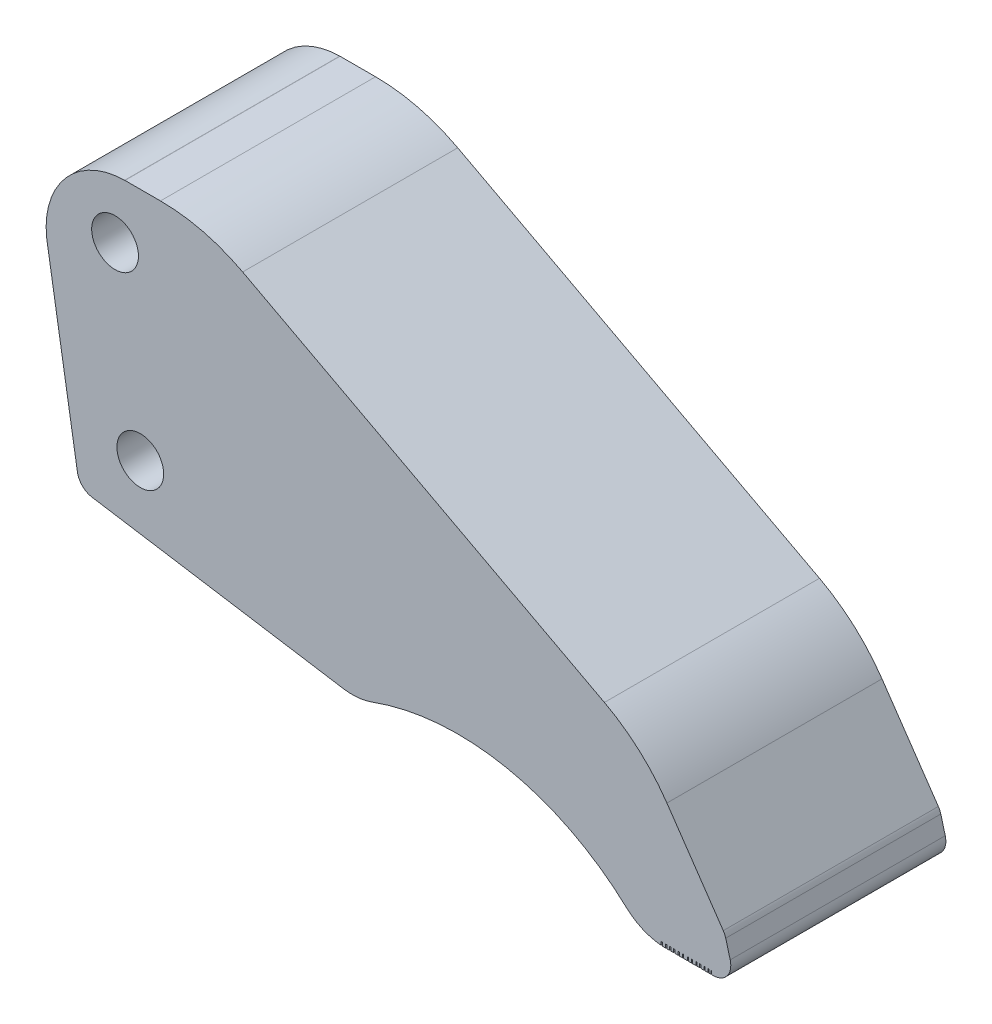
ISO-10303-21;
HEADER;
FILE_DESCRIPTION(('STEP AP214'),'2;1');
FILE_NAME('part.step','',(''),(''),'','','');
FILE_SCHEMA(('AUTOMOTIVE_DESIGN { 1 0 10303 214 1 1 1 1 }'));
ENDSEC;
DATA;
#1=APPLICATION_CONTEXT('core data for automotive mechanical design processes');
#2=APPLICATION_PROTOCOL_DEFINITION('international standard','automotive_design',2000,#1);
#3=PRODUCT_CONTEXT('',#1,'mechanical');
#4=PRODUCT('Part','Part','',(#3));
#5=PRODUCT_RELATED_PRODUCT_CATEGORY('part','',(#4));
#6=PRODUCT_DEFINITION_FORMATION('','',#4);
#7=PRODUCT_DEFINITION_CONTEXT('part definition',#1,'design');
#8=PRODUCT_DEFINITION('design','',#6,#7);
#9=PRODUCT_DEFINITION_SHAPE('','',#8);
#10=(LENGTH_UNIT() NAMED_UNIT(*) SI_UNIT(.MILLI.,.METRE.));
#11=(NAMED_UNIT(*) PLANE_ANGLE_UNIT() SI_UNIT($,.RADIAN.));
#12=(NAMED_UNIT(*) SI_UNIT($,.STERADIAN.) SOLID_ANGLE_UNIT());
#13=UNCERTAINTY_MEASURE_WITH_UNIT(LENGTH_MEASURE(1.E-05),#10,'distance_accuracy_value','');
#14=(GEOMETRIC_REPRESENTATION_CONTEXT(3) GLOBAL_UNCERTAINTY_ASSIGNED_CONTEXT((#13)) GLOBAL_UNIT_ASSIGNED_CONTEXT((#10,
#11,#12)) REPRESENTATION_CONTEXT('',''));
#15=CARTESIAN_POINT('',(0.,0.,0.));
#16=DIRECTION('',(0.,0.,1.));
#17=DIRECTION('',(1.,0.,0.));
#18=AXIS2_PLACEMENT_3D('',#15,#16,#17);
#19=CARTESIAN_POINT('',(3.94838006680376,39.6958814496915,36.8));
#20=DIRECTION('',(0.,0.,-1.));
#21=DIRECTION('',(-1.,0.,0.));
#22=AXIS2_PLACEMENT_3D('',#19,#20,#21);
#23=CYLINDRICAL_SURFACE('',#22,4.);
#24=CARTESIAN_POINT('',(3.94838006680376,39.6958814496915,36.8));
#25=DIRECTION('',(0.,0.,1.));
#26=DIRECTION('',(1.,0.,0.));
#27=AXIS2_PLACEMENT_3D('',#24,#25,#26);
#28=CIRCLE('',#27,4.);
#29=CARTESIAN_POINT('',(7.94838006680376,39.6958814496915,36.8));
#30=VERTEX_POINT('',#29);
#31=EDGE_CURVE('E533',#30,#30,#28,.T.);
#32=ORIENTED_EDGE('',*,*,#31,.T.);
#33=EDGE_LOOP('',(#32));
#34=FACE_BOUND('',#33,.T.);
#35=CARTESIAN_POINT('',(3.94838006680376,39.6958814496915,0.));
#36=DIRECTION('',(0.,0.,1.));
#37=DIRECTION('',(1.,0.,0.));
#38=AXIS2_PLACEMENT_3D('',#35,#36,#37);
#39=CIRCLE('',#38,4.);
#40=CARTESIAN_POINT('',(7.94838006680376,39.6958814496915,0.));
#41=VERTEX_POINT('',#40);
#42=EDGE_CURVE('E359',#41,#41,#39,.T.);
#43=ORIENTED_EDGE('',*,*,#42,.F.);
#44=EDGE_LOOP('',(#43));
#45=FACE_BOUND('',#44,.T.);
#46=ADVANCED_FACE('F241',(#34,#45),#23,.F.);
#47=CARTESIAN_POINT('',(8.26752681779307,9.56172754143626,36.8));
#48=DIRECTION('',(0.,0.,-1.));
#49=DIRECTION('',(-1.,0.,0.));
#50=AXIS2_PLACEMENT_3D('',#47,#48,#49);
#51=CYLINDRICAL_SURFACE('',#50,4.);
#52=CARTESIAN_POINT('',(8.26752681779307,9.56172754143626,36.8));
#53=DIRECTION('',(0.,0.,1.));
#54=DIRECTION('',(1.,0.,0.));
#55=AXIS2_PLACEMENT_3D('',#52,#53,#54);
#56=CIRCLE('',#55,4.);
#57=CARTESIAN_POINT('',(12.2675268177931,9.56172754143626,36.8));
#58=VERTEX_POINT('',#57);
#59=EDGE_CURVE('E530',#58,#58,#56,.T.);
#60=ORIENTED_EDGE('',*,*,#59,.T.);
#61=EDGE_LOOP('',(#60));
#62=FACE_BOUND('',#61,.T.);
#63=CARTESIAN_POINT('',(8.26752681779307,9.56172754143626,0.));
#64=DIRECTION('',(0.,0.,1.));
#65=DIRECTION('',(1.,0.,0.));
#66=AXIS2_PLACEMENT_3D('',#63,#64,#65);
#67=CIRCLE('',#66,4.);
#68=CARTESIAN_POINT('',(12.2675268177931,9.56172754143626,0.));
#69=VERTEX_POINT('',#68);
#70=EDGE_CURVE('E709',#69,#69,#67,.T.);
#71=ORIENTED_EDGE('',*,*,#70,.F.);
#72=EDGE_LOOP('',(#71));
#73=FACE_BOUND('',#72,.T.);
#74=ADVANCED_FACE('F1422',(#62,#73),#51,.F.);
#75=CARTESIAN_POINT('',(97.372163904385,0.,36.8));
#76=DIRECTION('',(1.,0.,0.));
#77=DIRECTION('',(0.,0.,-1.));
#78=AXIS2_PLACEMENT_3D('',#75,#76,#77);
#79=PLANE('',#78);
#80=DIRECTION('',(0.,-1.,0.));
#81=VECTOR('',#80,1.);
#82=CARTESIAN_POINT('',(97.372163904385,0.,0.));
#83=LINE('',#82,#81);
#84=CARTESIAN_POINT('',(97.372163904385,-17.1380331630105,0.));
#85=VERTEX_POINT('',#84);
#86=CARTESIAN_POINT('',(97.372163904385,-17.7071736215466,0.));
#87=VERTEX_POINT('',#86);
#88=EDGE_CURVE('E538',#85,#87,#83,.T.);
#89=ORIENTED_EDGE('',*,*,#88,.F.);
#90=DIRECTION('',(0.,0.,-1.));
#91=VECTOR('',#90,1.);
#92=CARTESIAN_POINT('',(97.372163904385,-17.1380331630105,36.8));
#93=LINE('',#92,#91);
#94=CARTESIAN_POINT('',(97.372163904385,-17.1380331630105,36.8));
#95=VERTEX_POINT('',#94);
#96=EDGE_CURVE('E902',#95,#85,#93,.T.);
#97=ORIENTED_EDGE('',*,*,#96,.F.);
#98=DIRECTION('',(0.,-1.,0.));
#99=VECTOR('',#98,1.);
#100=CARTESIAN_POINT('',(97.372163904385,0.,36.8));
#101=LINE('',#100,#99);
#102=CARTESIAN_POINT('',(97.372163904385,-17.7071736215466,36.8));
#103=VERTEX_POINT('',#102);
#104=EDGE_CURVE('E358',#95,#103,#101,.T.);
#105=ORIENTED_EDGE('',*,*,#104,.T.);
#106=DIRECTION('',(0.,0.,-1.));
#107=VECTOR('',#106,1.);
#108=CARTESIAN_POINT('',(97.372163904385,-17.7071736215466,36.8));
#109=LINE('',#108,#107);
#110=EDGE_CURVE('E905',#103,#87,#109,.T.);
#111=ORIENTED_EDGE('',*,*,#110,.T.);
#112=EDGE_LOOP('',(#89,#97,#105,#111));
#113=FACE_BOUND('',#112,.T.);
#114=ADVANCED_FACE('F1428',(#113),#79,.T.);
#115=CARTESIAN_POINT('',(0.,-17.1380331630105,36.8));
#116=DIRECTION('',(0.,-1.,0.));
#117=DIRECTION('',(0.,0.,-1.));
#118=AXIS2_PLACEMENT_3D('',#115,#116,#117);
#119=PLANE('',#118);
#120=DIRECTION('',(-1.,0.,0.));
#121=VECTOR('',#120,1.);
#122=CARTESIAN_POINT('',(0.,-17.1380331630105,0.));
#123=LINE('',#122,#121);
#124=CARTESIAN_POINT('',(97.6534848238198,-17.1380331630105,0.));
#125=VERTEX_POINT('',#124);
#126=EDGE_CURVE('E541',#125,#85,#123,.T.);
#127=ORIENTED_EDGE('',*,*,#126,.F.);
#128=DIRECTION('',(0.,0.,-1.));
#129=VECTOR('',#128,1.);
#130=CARTESIAN_POINT('',(97.6534848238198,-17.1380331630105,36.8));
#131=LINE('',#130,#129);
#132=CARTESIAN_POINT('',(97.6534848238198,-17.1380331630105,36.8));
#133=VERTEX_POINT('',#132);
#134=EDGE_CURVE('E899',#133,#125,#131,.T.);
#135=ORIENTED_EDGE('',*,*,#134,.F.);
#136=DIRECTION('',(-1.,0.,0.));
#137=VECTOR('',#136,1.);
#138=CARTESIAN_POINT('',(0.,-17.1380331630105,36.8));
#139=LINE('',#138,#137);
#140=EDGE_CURVE('E362',#133,#95,#139,.T.);
#141=ORIENTED_EDGE('',*,*,#140,.T.);
#142=ORIENTED_EDGE('',*,*,#96,.T.);
#143=EDGE_LOOP('',(#127,#135,#141,#142));
#144=FACE_BOUND('',#143,.T.);
#145=ADVANCED_FACE('F1510',(#144),#119,.T.);
#146=CARTESIAN_POINT('',(97.6534848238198,0.,36.8));
#147=DIRECTION('',(1.,0.,0.));
#148=DIRECTION('',(0.,0.,-1.));
#149=AXIS2_PLACEMENT_3D('',#146,#147,#148);
#150=PLANE('',#149);
#151=DIRECTION('',(0.,-1.,0.));
#152=VECTOR('',#151,1.);
#153=CARTESIAN_POINT('',(97.6534848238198,0.,0.));
#154=LINE('',#153,#152);
#155=CARTESIAN_POINT('',(97.6534848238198,-17.7275908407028,0.));
#156=VERTEX_POINT('',#155);
#157=EDGE_CURVE('E544',#125,#156,#154,.T.);
#158=ORIENTED_EDGE('',*,*,#157,.T.);
#159=DIRECTION('',(0.,0.,-1.));
#160=VECTOR('',#159,1.);
#161=CARTESIAN_POINT('',(97.6534848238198,-17.7275908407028,36.8));
#162=LINE('',#161,#160);
#163=CARTESIAN_POINT('',(97.6534848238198,-17.7275908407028,36.8));
#164=VERTEX_POINT('',#163);
#165=EDGE_CURVE('E896',#164,#156,#162,.T.);
#166=ORIENTED_EDGE('',*,*,#165,.F.);
#167=DIRECTION('',(0.,-1.,0.));
#168=VECTOR('',#167,1.);
#169=CARTESIAN_POINT('',(97.6534848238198,0.,36.8));
#170=LINE('',#169,#168);
#171=EDGE_CURVE('E365',#133,#164,#170,.T.);
#172=ORIENTED_EDGE('',*,*,#171,.F.);
#173=ORIENTED_EDGE('',*,*,#134,.T.);
#174=EDGE_LOOP('',(#158,#166,#172,#173));
#175=FACE_BOUND('',#174,.T.);
#176=ADVANCED_FACE('F1591',(#175),#150,.F.);
#177=CARTESIAN_POINT('',(98.2366110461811,-7.74460712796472,36.8));
#178=DIRECTION('',(0.,0.,-1.));
#179=DIRECTION('',(-1.,0.,0.));
#180=AXIS2_PLACEMENT_3D('',#177,#178,#179);
#181=CYLINDRICAL_SURFACE('',#180,10.);
#182=CARTESIAN_POINT('',(98.2366110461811,-7.74460712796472,0.));
#183=DIRECTION('',(0.,0.,1.));
#184=DIRECTION('',(1.,0.,0.));
#185=AXIS2_PLACEMENT_3D('',#182,#183,#184);
#186=CIRCLE('',#185,10.);
#187=CARTESIAN_POINT('',(98.1601019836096,-17.7443144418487,0.));
#188=VERTEX_POINT('',#187);
#189=EDGE_CURVE('E549',#188,#156,#186,.F.);
#190=ORIENTED_EDGE('',*,*,#189,.F.);
#191=DIRECTION('',(0.,0.,-1.));
#192=VECTOR('',#191,1.);
#193=CARTESIAN_POINT('',(98.1601019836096,-17.7443144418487,36.8));
#194=LINE('',#193,#192);
#195=CARTESIAN_POINT('',(98.1601019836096,-17.7443144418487,36.8));
#196=VERTEX_POINT('',#195);
#197=EDGE_CURVE('E893',#196,#188,#194,.T.);
#198=ORIENTED_EDGE('',*,*,#197,.F.);
#199=CARTESIAN_POINT('',(98.2366110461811,-7.74460712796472,36.8));
#200=DIRECTION('',(0.,0.,1.));
#201=DIRECTION('',(1.,0.,0.));
#202=AXIS2_PLACEMENT_3D('',#199,#200,#201);
#203=CIRCLE('',#202,10.);
#204=EDGE_CURVE('E370',#196,#164,#203,.F.);
#205=ORIENTED_EDGE('',*,*,#204,.T.);
#206=ORIENTED_EDGE('',*,*,#165,.T.);
#207=EDGE_LOOP('',(#190,#198,#205,#206));
#208=FACE_BOUND('',#207,.T.);
#209=ADVANCED_FACE('F1587',(#208),#181,.T.);
#210=CARTESIAN_POINT('',(98.1601019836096,0.,36.8));
#211=DIRECTION('',(1.,0.,0.));
#212=DIRECTION('',(0.,0.,-1.));
#213=AXIS2_PLACEMENT_3D('',#210,#211,#212);
#214=PLANE('',#213);
#215=DIRECTION('',(0.,-1.,0.));
#216=VECTOR('',#215,1.);
#217=CARTESIAN_POINT('',(98.1601019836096,0.,0.));
#218=LINE('',#217,#216);
#219=CARTESIAN_POINT('',(98.1601019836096,-17.1380331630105,0.));
#220=VERTEX_POINT('',#219);
#221=EDGE_CURVE('E552',#220,#188,#218,.T.);
#222=ORIENTED_EDGE('',*,*,#221,.F.);
#223=DIRECTION('',(0.,0.,-1.));
#224=VECTOR('',#223,1.);
#225=CARTESIAN_POINT('',(98.1601019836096,-17.1380331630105,36.8));
#226=LINE('',#225,#224);
#227=CARTESIAN_POINT('',(98.1601019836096,-17.1380331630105,36.8));
#228=VERTEX_POINT('',#227);
#229=EDGE_CURVE('E890',#228,#220,#226,.T.);
#230=ORIENTED_EDGE('',*,*,#229,.F.);
#231=DIRECTION('',(0.,-1.,0.));
#232=VECTOR('',#231,1.);
#233=CARTESIAN_POINT('',(98.1601019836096,0.,36.8));
#234=LINE('',#233,#232);
#235=EDGE_CURVE('E373',#228,#196,#234,.T.);
#236=ORIENTED_EDGE('',*,*,#235,.T.);
#237=ORIENTED_EDGE('',*,*,#197,.T.);
#238=EDGE_LOOP('',(#222,#230,#236,#237));
#239=FACE_BOUND('',#238,.T.);
#240=ADVANCED_FACE('F1581',(#239),#214,.T.);
#241=CARTESIAN_POINT('',(98.378364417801,-17.1380331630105,0.));
#242=VERTEX_POINT('',#241);
#243=EDGE_CURVE('E546',#242,#220,#123,.T.);
#244=ORIENTED_EDGE('',*,*,#243,.F.);
#245=DIRECTION('',(0.,0.,-1.));
#246=VECTOR('',#245,1.);
#247=CARTESIAN_POINT('',(98.378364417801,-17.1380331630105,36.8));
#248=LINE('',#247,#246);
#249=CARTESIAN_POINT('',(98.378364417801,-17.1380331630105,36.8));
#250=VERTEX_POINT('',#249);
#251=EDGE_CURVE('E887',#250,#242,#248,.T.);
#252=ORIENTED_EDGE('',*,*,#251,.F.);
#253=EDGE_CURVE('E367',#250,#228,#139,.T.);
#254=ORIENTED_EDGE('',*,*,#253,.T.);
#255=ORIENTED_EDGE('',*,*,#229,.T.);
#256=EDGE_LOOP('',(#244,#252,#254,#255));
#257=FACE_BOUND('',#256,.T.);
#258=ADVANCED_FACE('F979',(#257),#119,.T.);
#259=CARTESIAN_POINT('',(98.378364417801,0.,36.8));
#260=DIRECTION('',(1.,0.,0.));
#261=DIRECTION('',(0.,0.,-1.));
#262=AXIS2_PLACEMENT_3D('',#259,#260,#261);
#263=PLANE('',#262);
#264=DIRECTION('',(0.,-1.,0.));
#265=VECTOR('',#264,1.);
#266=CARTESIAN_POINT('',(98.378364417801,0.,0.));
#267=LINE('',#266,#265);
#268=CARTESIAN_POINT('',(98.378364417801,-17.7446071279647,0.));
#269=VERTEX_POINT('',#268);
#270=EDGE_CURVE('E555',#242,#269,#267,.T.);
#271=ORIENTED_EDGE('',*,*,#270,.T.);
#272=DIRECTION('',(0.,0.,-1.));
#273=VECTOR('',#272,1.);
#274=CARTESIAN_POINT('',(98.378364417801,-17.7446071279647,36.8));
#275=LINE('',#274,#273);
#276=CARTESIAN_POINT('',(98.378364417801,-17.7446071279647,36.8));
#277=VERTEX_POINT('',#276);
#278=EDGE_CURVE('E884',#277,#269,#275,.T.);
#279=ORIENTED_EDGE('',*,*,#278,.F.);
#280=DIRECTION('',(0.,-1.,0.));
#281=VECTOR('',#280,1.);
#282=CARTESIAN_POINT('',(98.378364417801,0.,36.8));
#283=LINE('',#282,#281);
#284=EDGE_CURVE('E376',#250,#277,#283,.T.);
#285=ORIENTED_EDGE('',*,*,#284,.F.);
#286=ORIENTED_EDGE('',*,*,#251,.T.);
#287=EDGE_LOOP('',(#271,#279,#285,#286));
#288=FACE_BOUND('',#287,.T.);
#289=ADVANCED_FACE('F1298',(#288),#263,.F.);
#290=CARTESIAN_POINT('',(0.,-17.7446071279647,36.8));
#291=DIRECTION('',(0.,-1.,0.));
#292=DIRECTION('',(1.,0.,0.));
#293=AXIS2_PLACEMENT_3D('',#290,#291,#292);
#294=PLANE('',#293);
#295=DIRECTION('',(-1.,0.,0.));
#296=VECTOR('',#295,1.);
#297=CARTESIAN_POINT('',(0.,-17.7446071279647,0.));
#298=LINE('',#297,#296);
#299=CARTESIAN_POINT('',(98.8220387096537,-17.7446071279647,0.));
#300=VERTEX_POINT('',#299);
#301=EDGE_CURVE('E558',#300,#269,#298,.T.);
#302=ORIENTED_EDGE('',*,*,#301,.F.);
#303=DIRECTION('',(0.,0.,-1.));
#304=VECTOR('',#303,1.);
#305=CARTESIAN_POINT('',(98.8220387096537,-17.7446071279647,36.8));
#306=LINE('',#305,#304);
#307=CARTESIAN_POINT('',(98.8220387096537,-17.7446071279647,36.8));
#308=VERTEX_POINT('',#307);
#309=EDGE_CURVE('E881',#308,#300,#306,.T.);
#310=ORIENTED_EDGE('',*,*,#309,.F.);
#311=DIRECTION('',(-1.,0.,0.));
#312=VECTOR('',#311,1.);
#313=CARTESIAN_POINT('',(0.,-17.7446071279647,36.8));
#314=LINE('',#313,#312);
#315=EDGE_CURVE('E379',#308,#277,#314,.T.);
#316=ORIENTED_EDGE('',*,*,#315,.T.);
#317=ORIENTED_EDGE('',*,*,#278,.T.);
#318=EDGE_LOOP('',(#302,#310,#316,#317));
#319=FACE_BOUND('',#318,.T.);
#320=ADVANCED_FACE('F1300',(#319),#294,.T.);
#321=CARTESIAN_POINT('',(98.8220387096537,0.,36.8));
#322=DIRECTION('',(1.,0.,0.));
#323=DIRECTION('',(0.,0.,-1.));
#324=AXIS2_PLACEMENT_3D('',#321,#322,#323);
#325=PLANE('',#324);
#326=DIRECTION('',(0.,-1.,0.));
#327=VECTOR('',#326,1.);
#328=CARTESIAN_POINT('',(98.8220387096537,0.,0.));
#329=LINE('',#328,#327);
#330=CARTESIAN_POINT('',(98.8220387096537,-17.1380331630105,0.));
#331=VERTEX_POINT('',#330);
#332=EDGE_CURVE('E561',#331,#300,#329,.T.);
#333=ORIENTED_EDGE('',*,*,#332,.F.);
#334=DIRECTION('',(0.,0.,-1.));
#335=VECTOR('',#334,1.);
#336=CARTESIAN_POINT('',(98.8220387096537,-17.1380331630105,36.8));
#337=LINE('',#336,#335);
#338=CARTESIAN_POINT('',(98.8220387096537,-17.1380331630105,36.8));
#339=VERTEX_POINT('',#338);
#340=EDGE_CURVE('E878',#339,#331,#337,.T.);
#341=ORIENTED_EDGE('',*,*,#340,.F.);
#342=DIRECTION('',(0.,-1.,0.));
#343=VECTOR('',#342,1.);
#344=CARTESIAN_POINT('',(98.8220387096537,0.,36.8));
#345=LINE('',#344,#343);
#346=EDGE_CURVE('E382',#339,#308,#345,.T.);
#347=ORIENTED_EDGE('',*,*,#346,.T.);
#348=ORIENTED_EDGE('',*,*,#309,.T.);
#349=EDGE_LOOP('',(#333,#341,#347,#348));
#350=FACE_BOUND('',#349,.T.);
#351=ADVANCED_FACE('F1304',(#350),#325,.T.);
#352=CARTESIAN_POINT('',(99.0508464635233,-17.1380331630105,0.));
#353=VERTEX_POINT('',#352);
#354=EDGE_CURVE('E564',#353,#331,#123,.T.);
#355=ORIENTED_EDGE('',*,*,#354,.F.);
#356=DIRECTION('',(0.,0.,-1.));
#357=VECTOR('',#356,1.);
#358=CARTESIAN_POINT('',(99.0508464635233,-17.1380331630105,36.8));
#359=LINE('',#358,#357);
#360=CARTESIAN_POINT('',(99.0508464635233,-17.1380331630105,36.8));
#361=VERTEX_POINT('',#360);
#362=EDGE_CURVE('E875',#361,#353,#359,.T.);
#363=ORIENTED_EDGE('',*,*,#362,.F.);
#364=EDGE_CURVE('E385',#361,#339,#139,.T.);
#365=ORIENTED_EDGE('',*,*,#364,.T.);
#366=ORIENTED_EDGE('',*,*,#340,.T.);
#367=EDGE_LOOP('',(#355,#363,#365,#366));
#368=FACE_BOUND('',#367,.T.);
#369=ADVANCED_FACE('F1305',(#368),#119,.T.);
#370=CARTESIAN_POINT('',(99.0508464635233,0.,36.8));
#371=DIRECTION('',(1.,0.,0.));
#372=DIRECTION('',(0.,0.,-1.));
#373=AXIS2_PLACEMENT_3D('',#370,#371,#372);
#374=PLANE('',#373);
#375=DIRECTION('',(0.,-1.,0.));
#376=VECTOR('',#375,1.);
#377=CARTESIAN_POINT('',(99.0508464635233,0.,0.));
#378=LINE('',#377,#376);
#379=CARTESIAN_POINT('',(99.0508464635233,-17.7446071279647,0.));
#380=VERTEX_POINT('',#379);
#381=EDGE_CURVE('E565',#353,#380,#378,.T.);
#382=ORIENTED_EDGE('',*,*,#381,.T.);
#383=DIRECTION('',(0.,0.,-1.));
#384=VECTOR('',#383,1.);
#385=CARTESIAN_POINT('',(99.0508464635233,-17.7446071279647,36.8));
#386=LINE('',#385,#384);
#387=CARTESIAN_POINT('',(99.0508464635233,-17.7446071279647,36.8));
#388=VERTEX_POINT('',#387);
#389=EDGE_CURVE('E872',#388,#380,#386,.T.);
#390=ORIENTED_EDGE('',*,*,#389,.F.);
#391=DIRECTION('',(0.,-1.,0.));
#392=VECTOR('',#391,1.);
#393=CARTESIAN_POINT('',(99.0508464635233,0.,36.8));
#394=LINE('',#393,#392);
#395=EDGE_CURVE('E386',#361,#388,#394,.T.);
#396=ORIENTED_EDGE('',*,*,#395,.F.);
#397=ORIENTED_EDGE('',*,*,#362,.T.);
#398=EDGE_LOOP('',(#382,#390,#396,#397));
#399=FACE_BOUND('',#398,.T.);
#400=ADVANCED_FACE('F1309',(#399),#374,.F.);
#401=CARTESIAN_POINT('',(0.,-17.7446071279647,36.8));
#402=DIRECTION('',(0.,-1.,0.));
#403=DIRECTION('',(1.,0.,0.));
#404=AXIS2_PLACEMENT_3D('',#401,#402,#403);
#405=PLANE('',#404);
#406=DIRECTION('',(-1.,0.,0.));
#407=VECTOR('',#406,1.);
#408=CARTESIAN_POINT('',(0.,-17.7446071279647,0.));
#409=LINE('',#408,#407);
#410=CARTESIAN_POINT('',(99.4921185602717,-17.7446071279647,0.));
#411=VERTEX_POINT('',#410);
#412=EDGE_CURVE('E568',#411,#380,#409,.T.);
#413=ORIENTED_EDGE('',*,*,#412,.F.);
#414=DIRECTION('',(0.,0.,-1.));
#415=VECTOR('',#414,1.);
#416=CARTESIAN_POINT('',(99.4921185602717,-17.7446071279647,36.8));
#417=LINE('',#416,#415);
#418=CARTESIAN_POINT('',(99.4921185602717,-17.7446071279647,36.8));
#419=VERTEX_POINT('',#418);
#420=EDGE_CURVE('E869',#419,#411,#417,.T.);
#421=ORIENTED_EDGE('',*,*,#420,.F.);
#422=DIRECTION('',(-1.,0.,0.));
#423=VECTOR('',#422,1.);
#424=CARTESIAN_POINT('',(0.,-17.7446071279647,36.8));
#425=LINE('',#424,#423);
#426=EDGE_CURVE('E389',#419,#388,#425,.T.);
#427=ORIENTED_EDGE('',*,*,#426,.T.);
#428=ORIENTED_EDGE('',*,*,#389,.T.);
#429=EDGE_LOOP('',(#413,#421,#427,#428));
#430=FACE_BOUND('',#429,.T.);
#431=ADVANCED_FACE('F1571',(#430),#405,.T.);
#432=CARTESIAN_POINT('',(99.4921185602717,0.,36.8));
#433=DIRECTION('',(1.,0.,0.));
#434=DIRECTION('',(0.,0.,-1.));
#435=AXIS2_PLACEMENT_3D('',#432,#433,#434);
#436=PLANE('',#435);
#437=DIRECTION('',(0.,-1.,0.));
#438=VECTOR('',#437,1.);
#439=CARTESIAN_POINT('',(99.4921185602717,0.,0.));
#440=LINE('',#439,#438);
#441=CARTESIAN_POINT('',(99.4921185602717,-17.1380331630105,0.));
#442=VERTEX_POINT('',#441);
#443=EDGE_CURVE('E571',#442,#411,#440,.T.);
#444=ORIENTED_EDGE('',*,*,#443,.F.);
#445=DIRECTION('',(0.,0.,-1.));
#446=VECTOR('',#445,1.);
#447=CARTESIAN_POINT('',(99.4921185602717,-17.1380331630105,36.8));
#448=LINE('',#447,#446);
#449=CARTESIAN_POINT('',(99.4921185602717,-17.1380331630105,36.8));
#450=VERTEX_POINT('',#449);
#451=EDGE_CURVE('E866',#450,#442,#448,.T.);
#452=ORIENTED_EDGE('',*,*,#451,.F.);
#453=DIRECTION('',(0.,-1.,0.));
#454=VECTOR('',#453,1.);
#455=CARTESIAN_POINT('',(99.4921185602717,0.,36.8));
#456=LINE('',#455,#454);
#457=EDGE_CURVE('E392',#450,#419,#456,.T.);
#458=ORIENTED_EDGE('',*,*,#457,.T.);
#459=ORIENTED_EDGE('',*,*,#420,.T.);
#460=EDGE_LOOP('',(#444,#452,#458,#459));
#461=FACE_BOUND('',#460,.T.);
#462=ADVANCED_FACE('F1315',(#461),#436,.T.);
#463=CARTESIAN_POINT('',(99.7699565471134,-17.1380331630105,0.));
#464=VERTEX_POINT('',#463);
#465=EDGE_CURVE('E574',#464,#442,#123,.T.);
#466=ORIENTED_EDGE('',*,*,#465,.F.);
#467=DIRECTION('',(0.,0.,-1.));
#468=VECTOR('',#467,1.);
#469=CARTESIAN_POINT('',(99.7699565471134,-17.1380331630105,36.8));
#470=LINE('',#469,#468);
#471=CARTESIAN_POINT('',(99.7699565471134,-17.1380331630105,36.8));
#472=VERTEX_POINT('',#471);
#473=EDGE_CURVE('E863',#472,#464,#470,.T.);
#474=ORIENTED_EDGE('',*,*,#473,.F.);
#475=EDGE_CURVE('E395',#472,#450,#139,.T.);
#476=ORIENTED_EDGE('',*,*,#475,.T.);
#477=ORIENTED_EDGE('',*,*,#451,.T.);
#478=EDGE_LOOP('',(#466,#474,#476,#477));
#479=FACE_BOUND('',#478,.T.);
#480=ADVANCED_FACE('F1317',(#479),#119,.T.);
#481=CARTESIAN_POINT('',(99.7699565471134,0.,36.8));
#482=DIRECTION('',(1.,0.,0.));
#483=DIRECTION('',(0.,0.,-1.));
#484=AXIS2_PLACEMENT_3D('',#481,#482,#483);
#485=PLANE('',#484);
#486=DIRECTION('',(0.,-1.,0.));
#487=VECTOR('',#486,1.);
#488=CARTESIAN_POINT('',(99.7699565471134,0.,0.));
#489=LINE('',#488,#487);
#490=CARTESIAN_POINT('',(99.7699565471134,-17.7446071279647,0.));
#491=VERTEX_POINT('',#490);
#492=EDGE_CURVE('E575',#464,#491,#489,.T.);
#493=ORIENTED_EDGE('',*,*,#492,.T.);
#494=DIRECTION('',(0.,0.,-1.));
#495=VECTOR('',#494,1.);
#496=CARTESIAN_POINT('',(99.7699565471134,-17.7446071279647,36.8));
#497=LINE('',#496,#495);
#498=CARTESIAN_POINT('',(99.7699565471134,-17.7446071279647,36.8));
#499=VERTEX_POINT('',#498);
#500=EDGE_CURVE('E860',#499,#491,#497,.T.);
#501=ORIENTED_EDGE('',*,*,#500,.F.);
#502=DIRECTION('',(0.,-1.,0.));
#503=VECTOR('',#502,1.);
#504=CARTESIAN_POINT('',(99.7699565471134,0.,36.8));
#505=LINE('',#504,#503);
#506=EDGE_CURVE('E396',#472,#499,#505,.T.);
#507=ORIENTED_EDGE('',*,*,#506,.F.);
#508=ORIENTED_EDGE('',*,*,#473,.T.);
#509=EDGE_LOOP('',(#493,#501,#507,#508));
#510=FACE_BOUND('',#509,.T.);
#511=ADVANCED_FACE('F1321',(#510),#485,.F.);
#512=CARTESIAN_POINT('',(0.,-17.7446071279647,36.8));
#513=DIRECTION('',(0.,-1.,0.));
#514=DIRECTION('',(1.,0.,0.));
#515=AXIS2_PLACEMENT_3D('',#512,#513,#514);
#516=PLANE('',#515);
#517=DIRECTION('',(-1.,0.,0.));
#518=VECTOR('',#517,1.);
#519=CARTESIAN_POINT('',(0.,-17.7446071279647,0.));
#520=LINE('',#519,#518);
#521=CARTESIAN_POINT('',(100.309289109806,-17.7446071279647,0.));
#522=VERTEX_POINT('',#521);
#523=EDGE_CURVE('E578',#522,#491,#520,.T.);
#524=ORIENTED_EDGE('',*,*,#523,.F.);
#525=DIRECTION('',(0.,0.,-1.));
#526=VECTOR('',#525,1.);
#527=CARTESIAN_POINT('',(100.309289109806,-17.7446071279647,36.8));
#528=LINE('',#527,#526);
#529=CARTESIAN_POINT('',(100.309289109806,-17.7446071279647,36.8));
#530=VERTEX_POINT('',#529);
#531=EDGE_CURVE('E857',#530,#522,#528,.T.);
#532=ORIENTED_EDGE('',*,*,#531,.F.);
#533=DIRECTION('',(-1.,0.,0.));
#534=VECTOR('',#533,1.);
#535=CARTESIAN_POINT('',(0.,-17.7446071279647,36.8));
#536=LINE('',#535,#534);
#537=EDGE_CURVE('E399',#530,#499,#536,.T.);
#538=ORIENTED_EDGE('',*,*,#537,.T.);
#539=ORIENTED_EDGE('',*,*,#500,.T.);
#540=EDGE_LOOP('',(#524,#532,#538,#539));
#541=FACE_BOUND('',#540,.T.);
#542=ADVANCED_FACE('F1563',(#541),#516,.T.);
#543=CARTESIAN_POINT('',(100.309289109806,0.,36.8));
#544=DIRECTION('',(1.,0.,0.));
#545=DIRECTION('',(0.,0.,-1.));
#546=AXIS2_PLACEMENT_3D('',#543,#544,#545);
#547=PLANE('',#546);
#548=DIRECTION('',(0.,-1.,0.));
#549=VECTOR('',#548,1.);
#550=CARTESIAN_POINT('',(100.309289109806,0.,0.));
#551=LINE('',#550,#549);
#552=CARTESIAN_POINT('',(100.309289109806,-17.1380331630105,0.));
#553=VERTEX_POINT('',#552);
#554=EDGE_CURVE('E581',#553,#522,#551,.T.);
#555=ORIENTED_EDGE('',*,*,#554,.F.);
#556=DIRECTION('',(0.,0.,-1.));
#557=VECTOR('',#556,1.);
#558=CARTESIAN_POINT('',(100.309289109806,-17.1380331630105,36.8));
#559=LINE('',#558,#557);
#560=CARTESIAN_POINT('',(100.309289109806,-17.1380331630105,36.8));
#561=VERTEX_POINT('',#560);
#562=EDGE_CURVE('E854',#561,#553,#559,.T.);
#563=ORIENTED_EDGE('',*,*,#562,.F.);
#564=DIRECTION('',(0.,-1.,0.));
#565=VECTOR('',#564,1.);
#566=CARTESIAN_POINT('',(100.309289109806,0.,36.8));
#567=LINE('',#566,#565);
#568=EDGE_CURVE('E402',#561,#530,#567,.T.);
#569=ORIENTED_EDGE('',*,*,#568,.T.);
#570=ORIENTED_EDGE('',*,*,#531,.T.);
#571=EDGE_LOOP('',(#555,#563,#569,#570));
#572=FACE_BOUND('',#571,.T.);
#573=ADVANCED_FACE('F1327',(#572),#547,.T.);
#574=CARTESIAN_POINT('',(100.521753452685,-17.1380331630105,0.));
#575=VERTEX_POINT('',#574);
#576=EDGE_CURVE('E584',#575,#553,#123,.T.);
#577=ORIENTED_EDGE('',*,*,#576,.F.);
#578=DIRECTION('',(0.,0.,-1.));
#579=VECTOR('',#578,1.);
#580=CARTESIAN_POINT('',(100.521753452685,-17.1380331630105,36.8));
#581=LINE('',#580,#579);
#582=CARTESIAN_POINT('',(100.521753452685,-17.1380331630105,36.8));
#583=VERTEX_POINT('',#582);
#584=EDGE_CURVE('E851',#583,#575,#581,.T.);
#585=ORIENTED_EDGE('',*,*,#584,.F.);
#586=EDGE_CURVE('E405',#583,#561,#139,.T.);
#587=ORIENTED_EDGE('',*,*,#586,.T.);
#588=ORIENTED_EDGE('',*,*,#562,.T.);
#589=EDGE_LOOP('',(#577,#585,#587,#588));
#590=FACE_BOUND('',#589,.T.);
#591=ADVANCED_FACE('F1329',(#590),#119,.T.);
#592=CARTESIAN_POINT('',(100.521753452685,0.,36.8));
#593=DIRECTION('',(1.,0.,0.));
#594=DIRECTION('',(0.,0.,-1.));
#595=AXIS2_PLACEMENT_3D('',#592,#593,#594);
#596=PLANE('',#595);
#597=DIRECTION('',(0.,-1.,0.));
#598=VECTOR('',#597,1.);
#599=CARTESIAN_POINT('',(100.521753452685,0.,0.));
#600=LINE('',#599,#598);
#601=CARTESIAN_POINT('',(100.521753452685,-17.7446071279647,0.));
#602=VERTEX_POINT('',#601);
#603=EDGE_CURVE('E585',#575,#602,#600,.T.);
#604=ORIENTED_EDGE('',*,*,#603,.T.);
#605=DIRECTION('',(0.,0.,-1.));
#606=VECTOR('',#605,1.);
#607=CARTESIAN_POINT('',(100.521753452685,-17.7446071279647,36.8));
#608=LINE('',#607,#606);
#609=CARTESIAN_POINT('',(100.521753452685,-17.7446071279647,36.8));
#610=VERTEX_POINT('',#609);
#611=EDGE_CURVE('E848',#610,#602,#608,.T.);
#612=ORIENTED_EDGE('',*,*,#611,.F.);
#613=DIRECTION('',(0.,-1.,0.));
#614=VECTOR('',#613,1.);
#615=CARTESIAN_POINT('',(100.521753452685,0.,36.8));
#616=LINE('',#615,#614);
#617=EDGE_CURVE('E406',#583,#610,#616,.T.);
#618=ORIENTED_EDGE('',*,*,#617,.F.);
#619=ORIENTED_EDGE('',*,*,#584,.T.);
#620=EDGE_LOOP('',(#604,#612,#618,#619));
#621=FACE_BOUND('',#620,.T.);
#622=ADVANCED_FACE('F1333',(#621),#596,.F.);
#623=CARTESIAN_POINT('',(0.,-17.7446071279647,36.8));
#624=DIRECTION('',(0.,-1.,0.));
#625=DIRECTION('',(1.,0.,0.));
#626=AXIS2_PLACEMENT_3D('',#623,#624,#625);
#627=PLANE('',#626);
#628=DIRECTION('',(-1.,0.,0.));
#629=VECTOR('',#628,1.);
#630=CARTESIAN_POINT('',(0.,-17.7446071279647,0.));
#631=LINE('',#630,#629);
#632=CARTESIAN_POINT('',(101.069257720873,-17.7446071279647,0.));
#633=VERTEX_POINT('',#632);
#634=EDGE_CURVE('E588',#633,#602,#631,.T.);
#635=ORIENTED_EDGE('',*,*,#634,.F.);
#636=DIRECTION('',(0.,0.,-1.));
#637=VECTOR('',#636,1.);
#638=CARTESIAN_POINT('',(101.069257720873,-17.7446071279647,36.8));
#639=LINE('',#638,#637);
#640=CARTESIAN_POINT('',(101.069257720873,-17.7446071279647,36.8));
#641=VERTEX_POINT('',#640);
#642=EDGE_CURVE('E845',#641,#633,#639,.T.);
#643=ORIENTED_EDGE('',*,*,#642,.F.);
#644=DIRECTION('',(-1.,0.,0.));
#645=VECTOR('',#644,1.);
#646=CARTESIAN_POINT('',(0.,-17.7446071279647,36.8));
#647=LINE('',#646,#645);
#648=EDGE_CURVE('E409',#641,#610,#647,.T.);
#649=ORIENTED_EDGE('',*,*,#648,.T.);
#650=ORIENTED_EDGE('',*,*,#611,.T.);
#651=EDGE_LOOP('',(#635,#643,#649,#650));
#652=FACE_BOUND('',#651,.T.);
#653=ADVANCED_FACE('F1555',(#652),#627,.T.);
#654=CARTESIAN_POINT('',(101.069257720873,0.,36.8));
#655=DIRECTION('',(1.,0.,0.));
#656=DIRECTION('',(0.,0.,-1.));
#657=AXIS2_PLACEMENT_3D('',#654,#655,#656);
#658=PLANE('',#657);
#659=DIRECTION('',(0.,-1.,0.));
#660=VECTOR('',#659,1.);
#661=CARTESIAN_POINT('',(101.069257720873,0.,0.));
#662=LINE('',#661,#660);
#663=CARTESIAN_POINT('',(101.069257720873,-17.1380331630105,0.));
#664=VERTEX_POINT('',#663);
#665=EDGE_CURVE('E591',#664,#633,#662,.T.);
#666=ORIENTED_EDGE('',*,*,#665,.F.);
#667=DIRECTION('',(0.,0.,-1.));
#668=VECTOR('',#667,1.);
#669=CARTESIAN_POINT('',(101.069257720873,-17.1380331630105,36.8));
#670=LINE('',#669,#668);
#671=CARTESIAN_POINT('',(101.069257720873,-17.1380331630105,36.8));
#672=VERTEX_POINT('',#671);
#673=EDGE_CURVE('E842',#672,#664,#670,.T.);
#674=ORIENTED_EDGE('',*,*,#673,.F.);
#675=DIRECTION('',(0.,-1.,0.));
#676=VECTOR('',#675,1.);
#677=CARTESIAN_POINT('',(101.069257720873,0.,36.8));
#678=LINE('',#677,#676);
#679=EDGE_CURVE('E412',#672,#641,#678,.T.);
#680=ORIENTED_EDGE('',*,*,#679,.T.);
#681=ORIENTED_EDGE('',*,*,#642,.T.);
#682=EDGE_LOOP('',(#666,#674,#680,#681));
#683=FACE_BOUND('',#682,.T.);
#684=ADVANCED_FACE('F1339',(#683),#658,.T.);
#685=CARTESIAN_POINT('',(101.191833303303,-17.1380331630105,0.));
#686=VERTEX_POINT('',#685);
#687=EDGE_CURVE('E594',#686,#664,#123,.T.);
#688=ORIENTED_EDGE('',*,*,#687,.F.);
#689=DIRECTION('',(0.,0.,-1.));
#690=VECTOR('',#689,1.);
#691=CARTESIAN_POINT('',(101.191833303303,-17.1380331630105,36.8));
#692=LINE('',#691,#690);
#693=CARTESIAN_POINT('',(101.191833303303,-17.1380331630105,36.8));
#694=VERTEX_POINT('',#693);
#695=EDGE_CURVE('E839',#694,#686,#692,.T.);
#696=ORIENTED_EDGE('',*,*,#695,.F.);
#697=EDGE_CURVE('E415',#694,#672,#139,.T.);
#698=ORIENTED_EDGE('',*,*,#697,.T.);
#699=ORIENTED_EDGE('',*,*,#673,.T.);
#700=EDGE_LOOP('',(#688,#696,#698,#699));
#701=FACE_BOUND('',#700,.T.);
#702=ADVANCED_FACE('F1341',(#701),#119,.T.);
#703=CARTESIAN_POINT('',(101.191833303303,0.,36.8));
#704=DIRECTION('',(1.,0.,0.));
#705=DIRECTION('',(0.,0.,-1.));
#706=AXIS2_PLACEMENT_3D('',#703,#704,#705);
#707=PLANE('',#706);
#708=DIRECTION('',(0.,-1.,0.));
#709=VECTOR('',#708,1.);
#710=CARTESIAN_POINT('',(101.191833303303,0.,0.));
#711=LINE('',#710,#709);
#712=CARTESIAN_POINT('',(101.191833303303,-17.7446071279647,0.));
#713=VERTEX_POINT('',#712);
#714=EDGE_CURVE('E595',#686,#713,#711,.T.);
#715=ORIENTED_EDGE('',*,*,#714,.T.);
#716=DIRECTION('',(0.,0.,-1.));
#717=VECTOR('',#716,1.);
#718=CARTESIAN_POINT('',(101.191833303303,-17.7446071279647,36.8));
#719=LINE('',#718,#717);
#720=CARTESIAN_POINT('',(101.191833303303,-17.7446071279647,36.8));
#721=VERTEX_POINT('',#720);
#722=EDGE_CURVE('E836',#721,#713,#719,.T.);
#723=ORIENTED_EDGE('',*,*,#722,.F.);
#724=DIRECTION('',(0.,-1.,0.));
#725=VECTOR('',#724,1.);
#726=CARTESIAN_POINT('',(101.191833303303,0.,36.8));
#727=LINE('',#726,#725);
#728=EDGE_CURVE('E416',#694,#721,#727,.T.);
#729=ORIENTED_EDGE('',*,*,#728,.F.);
#730=ORIENTED_EDGE('',*,*,#695,.T.);
#731=EDGE_LOOP('',(#715,#723,#729,#730));
#732=FACE_BOUND('',#731,.T.);
#733=ADVANCED_FACE('F1345',(#732),#707,.F.);
#734=CARTESIAN_POINT('',(0.,-17.7446071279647,36.8));
#735=DIRECTION('',(0.,-1.,0.));
#736=DIRECTION('',(1.,0.,0.));
#737=AXIS2_PLACEMENT_3D('',#734,#735,#736);
#738=PLANE('',#737);
#739=DIRECTION('',(-1.,0.,0.));
#740=VECTOR('',#739,1.);
#741=CARTESIAN_POINT('',(0.,-17.7446071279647,0.));
#742=LINE('',#741,#740);
#743=CARTESIAN_POINT('',(101.878256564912,-17.7446071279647,0.));
#744=VERTEX_POINT('',#743);
#745=EDGE_CURVE('E598',#744,#713,#742,.T.);
#746=ORIENTED_EDGE('',*,*,#745,.F.);
#747=DIRECTION('',(0.,0.,-1.));
#748=VECTOR('',#747,1.);
#749=CARTESIAN_POINT('',(101.878256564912,-17.7446071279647,36.8));
#750=LINE('',#749,#748);
#751=CARTESIAN_POINT('',(101.878256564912,-17.7446071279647,36.8));
#752=VERTEX_POINT('',#751);
#753=EDGE_CURVE('E833',#752,#744,#750,.T.);
#754=ORIENTED_EDGE('',*,*,#753,.F.);
#755=DIRECTION('',(-1.,0.,0.));
#756=VECTOR('',#755,1.);
#757=CARTESIAN_POINT('',(0.,-17.7446071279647,36.8));
#758=LINE('',#757,#756);
#759=EDGE_CURVE('E419',#752,#721,#758,.T.);
#760=ORIENTED_EDGE('',*,*,#759,.T.);
#761=ORIENTED_EDGE('',*,*,#722,.T.);
#762=EDGE_LOOP('',(#746,#754,#760,#761));
#763=FACE_BOUND('',#762,.T.);
#764=ADVANCED_FACE('F1547',(#763),#738,.T.);
#765=CARTESIAN_POINT('',(101.878256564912,0.,36.8));
#766=DIRECTION('',(1.,0.,0.));
#767=DIRECTION('',(0.,0.,-1.));
#768=AXIS2_PLACEMENT_3D('',#765,#766,#767);
#769=PLANE('',#768);
#770=DIRECTION('',(0.,-1.,0.));
#771=VECTOR('',#770,1.);
#772=CARTESIAN_POINT('',(101.878256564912,0.,0.));
#773=LINE('',#772,#771);
#774=CARTESIAN_POINT('',(101.878256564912,-17.1380331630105,0.));
#775=VERTEX_POINT('',#774);
#776=EDGE_CURVE('E601',#775,#744,#773,.T.);
#777=ORIENTED_EDGE('',*,*,#776,.F.);
#778=DIRECTION('',(0.,0.,-1.));
#779=VECTOR('',#778,1.);
#780=CARTESIAN_POINT('',(101.878256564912,-17.1380331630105,36.8));
#781=LINE('',#780,#779);
#782=CARTESIAN_POINT('',(101.878256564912,-17.1380331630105,36.8));
#783=VERTEX_POINT('',#782);
#784=EDGE_CURVE('E830',#783,#775,#781,.T.);
#785=ORIENTED_EDGE('',*,*,#784,.F.);
#786=DIRECTION('',(0.,-1.,0.));
#787=VECTOR('',#786,1.);
#788=CARTESIAN_POINT('',(101.878256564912,0.,36.8));
#789=LINE('',#788,#787);
#790=EDGE_CURVE('E422',#783,#752,#789,.T.);
#791=ORIENTED_EDGE('',*,*,#790,.T.);
#792=ORIENTED_EDGE('',*,*,#753,.T.);
#793=EDGE_LOOP('',(#777,#785,#791,#792));
#794=FACE_BOUND('',#793,.T.);
#795=ADVANCED_FACE('F1351',(#794),#769,.T.);
#796=CARTESIAN_POINT('',(102.049862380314,-17.1380331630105,0.));
#797=VERTEX_POINT('',#796);
#798=EDGE_CURVE('E604',#797,#775,#123,.T.);
#799=ORIENTED_EDGE('',*,*,#798,.F.);
#800=DIRECTION('',(0.,0.,-1.));
#801=VECTOR('',#800,1.);
#802=CARTESIAN_POINT('',(102.049862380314,-17.1380331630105,36.8));
#803=LINE('',#802,#801);
#804=CARTESIAN_POINT('',(102.049862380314,-17.1380331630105,36.8));
#805=VERTEX_POINT('',#804);
#806=EDGE_CURVE('E827',#805,#797,#803,.T.);
#807=ORIENTED_EDGE('',*,*,#806,.F.);
#808=EDGE_CURVE('E425',#805,#783,#139,.T.);
#809=ORIENTED_EDGE('',*,*,#808,.T.);
#810=ORIENTED_EDGE('',*,*,#784,.T.);
#811=EDGE_LOOP('',(#799,#807,#809,#810));
#812=FACE_BOUND('',#811,.T.);
#813=ADVANCED_FACE('F1353',(#812),#119,.T.);
#814=CARTESIAN_POINT('',(102.049862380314,0.,36.8));
#815=DIRECTION('',(1.,0.,0.));
#816=DIRECTION('',(0.,0.,-1.));
#817=AXIS2_PLACEMENT_3D('',#814,#815,#816);
#818=PLANE('',#817);
#819=DIRECTION('',(0.,-1.,0.));
#820=VECTOR('',#819,1.);
#821=CARTESIAN_POINT('',(102.049862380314,0.,0.));
#822=LINE('',#821,#820);
#823=CARTESIAN_POINT('',(102.049862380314,-17.7446071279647,0.));
#824=VERTEX_POINT('',#823);
#825=EDGE_CURVE('E605',#797,#824,#822,.T.);
#826=ORIENTED_EDGE('',*,*,#825,.T.);
#827=DIRECTION('',(0.,0.,-1.));
#828=VECTOR('',#827,1.);
#829=CARTESIAN_POINT('',(102.049862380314,-17.7446071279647,36.8));
#830=LINE('',#829,#828);
#831=CARTESIAN_POINT('',(102.049862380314,-17.7446071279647,36.8));
#832=VERTEX_POINT('',#831);
#833=EDGE_CURVE('E824',#832,#824,#830,.T.);
#834=ORIENTED_EDGE('',*,*,#833,.F.);
#835=DIRECTION('',(0.,-1.,0.));
#836=VECTOR('',#835,1.);
#837=CARTESIAN_POINT('',(102.049862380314,0.,36.8));
#838=LINE('',#837,#836);
#839=EDGE_CURVE('E426',#805,#832,#838,.T.);
#840=ORIENTED_EDGE('',*,*,#839,.F.);
#841=ORIENTED_EDGE('',*,*,#806,.T.);
#842=EDGE_LOOP('',(#826,#834,#840,#841));
#843=FACE_BOUND('',#842,.T.);
#844=ADVANCED_FACE('F1357',(#843),#818,.F.);
#845=CARTESIAN_POINT('',(0.,-17.7446071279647,36.8));
#846=DIRECTION('',(0.,-1.,0.));
#847=DIRECTION('',(1.,0.,0.));
#848=AXIS2_PLACEMENT_3D('',#845,#846,#847);
#849=PLANE('',#848);
#850=DIRECTION('',(-1.,0.,0.));
#851=VECTOR('',#850,1.);
#852=CARTESIAN_POINT('',(0.,-17.7446071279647,0.));
#853=LINE('',#852,#851);
#854=CARTESIAN_POINT('',(102.597366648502,-17.7446071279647,0.));
#855=VERTEX_POINT('',#854);
#856=EDGE_CURVE('E608',#855,#824,#853,.T.);
#857=ORIENTED_EDGE('',*,*,#856,.F.);
#858=DIRECTION('',(0.,0.,-1.));
#859=VECTOR('',#858,1.);
#860=CARTESIAN_POINT('',(102.597366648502,-17.7446071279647,36.8));
#861=LINE('',#860,#859);
#862=CARTESIAN_POINT('',(102.597366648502,-17.7446071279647,36.8));
#863=VERTEX_POINT('',#862);
#864=EDGE_CURVE('E821',#863,#855,#861,.T.);
#865=ORIENTED_EDGE('',*,*,#864,.F.);
#866=DIRECTION('',(-1.,0.,0.));
#867=VECTOR('',#866,1.);
#868=CARTESIAN_POINT('',(0.,-17.7446071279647,36.8));
#869=LINE('',#868,#867);
#870=EDGE_CURVE('E429',#863,#832,#869,.T.);
#871=ORIENTED_EDGE('',*,*,#870,.T.);
#872=ORIENTED_EDGE('',*,*,#833,.T.);
#873=EDGE_LOOP('',(#857,#865,#871,#872));
#874=FACE_BOUND('',#873,.T.);
#875=ADVANCED_FACE('F1539',(#874),#849,.T.);
#876=CARTESIAN_POINT('',(102.597366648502,0.,36.8));
#877=DIRECTION('',(1.,0.,0.));
#878=DIRECTION('',(0.,0.,-1.));
#879=AXIS2_PLACEMENT_3D('',#876,#877,#878);
#880=PLANE('',#879);
#881=DIRECTION('',(0.,-1.,0.));
#882=VECTOR('',#881,1.);
#883=CARTESIAN_POINT('',(102.597366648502,0.,0.));
#884=LINE('',#883,#882);
#885=CARTESIAN_POINT('',(102.597366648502,-17.1380331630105,0.));
#886=VERTEX_POINT('',#885);
#887=EDGE_CURVE('E611',#886,#855,#884,.T.);
#888=ORIENTED_EDGE('',*,*,#887,.F.);
#889=DIRECTION('',(0.,0.,-1.));
#890=VECTOR('',#889,1.);
#891=CARTESIAN_POINT('',(102.597366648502,-17.1380331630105,36.8));
#892=LINE('',#891,#890);
#893=CARTESIAN_POINT('',(102.597366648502,-17.1380331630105,36.8));
#894=VERTEX_POINT('',#893);
#895=EDGE_CURVE('E818',#894,#886,#892,.T.);
#896=ORIENTED_EDGE('',*,*,#895,.F.);
#897=DIRECTION('',(0.,-1.,0.));
#898=VECTOR('',#897,1.);
#899=CARTESIAN_POINT('',(102.597366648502,0.,36.8));
#900=LINE('',#899,#898);
#901=EDGE_CURVE('E432',#894,#863,#900,.T.);
#902=ORIENTED_EDGE('',*,*,#901,.T.);
#903=ORIENTED_EDGE('',*,*,#864,.T.);
#904=EDGE_LOOP('',(#888,#896,#902,#903));
#905=FACE_BOUND('',#904,.T.);
#906=ADVANCED_FACE('F1363',(#905),#880,.T.);
#907=CARTESIAN_POINT('',(102.713161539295,-17.1380331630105,0.));
#908=VERTEX_POINT('',#907);
#909=EDGE_CURVE('E614',#908,#886,#123,.T.);
#910=ORIENTED_EDGE('',*,*,#909,.F.);
#911=DIRECTION('',(0.,0.,-1.));
#912=VECTOR('',#911,1.);
#913=CARTESIAN_POINT('',(102.713161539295,-17.1380331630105,36.8));
#914=LINE('',#913,#912);
#915=CARTESIAN_POINT('',(102.713161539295,-17.1380331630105,36.8));
#916=VERTEX_POINT('',#915);
#917=EDGE_CURVE('E815',#916,#908,#914,.T.);
#918=ORIENTED_EDGE('',*,*,#917,.F.);
#919=EDGE_CURVE('E435',#916,#894,#139,.T.);
#920=ORIENTED_EDGE('',*,*,#919,.T.);
#921=ORIENTED_EDGE('',*,*,#895,.T.);
#922=EDGE_LOOP('',(#910,#918,#920,#921));
#923=FACE_BOUND('',#922,.T.);
#924=ADVANCED_FACE('F1365',(#923),#119,.T.);
#925=CARTESIAN_POINT('',(102.713161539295,0.,36.8));
#926=DIRECTION('',(1.,0.,0.));
#927=DIRECTION('',(0.,0.,-1.));
#928=AXIS2_PLACEMENT_3D('',#925,#926,#927);
#929=PLANE('',#928);
#930=DIRECTION('',(0.,-1.,0.));
#931=VECTOR('',#930,1.);
#932=CARTESIAN_POINT('',(102.713161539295,0.,0.));
#933=LINE('',#932,#931);
#934=CARTESIAN_POINT('',(102.713161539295,-17.7446071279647,0.));
#935=VERTEX_POINT('',#934);
#936=EDGE_CURVE('E615',#908,#935,#933,.T.);
#937=ORIENTED_EDGE('',*,*,#936,.T.);
#938=DIRECTION('',(0.,0.,-1.));
#939=VECTOR('',#938,1.);
#940=CARTESIAN_POINT('',(102.713161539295,-17.7446071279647,36.8));
#941=LINE('',#940,#939);
#942=CARTESIAN_POINT('',(102.713161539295,-17.7446071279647,36.8));
#943=VERTEX_POINT('',#942);
#944=EDGE_CURVE('E812',#943,#935,#941,.T.);
#945=ORIENTED_EDGE('',*,*,#944,.F.);
#946=DIRECTION('',(0.,-1.,0.));
#947=VECTOR('',#946,1.);
#948=CARTESIAN_POINT('',(102.713161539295,0.,36.8));
#949=LINE('',#948,#947);
#950=EDGE_CURVE('E436',#916,#943,#949,.T.);
#951=ORIENTED_EDGE('',*,*,#950,.F.);
#952=ORIENTED_EDGE('',*,*,#917,.T.);
#953=EDGE_LOOP('',(#937,#945,#951,#952));
#954=FACE_BOUND('',#953,.T.);
#955=ADVANCED_FACE('F1369',(#954),#929,.F.);
#956=CARTESIAN_POINT('',(0.,-17.7446071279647,36.8));
#957=DIRECTION('',(0.,-1.,0.));
#958=DIRECTION('',(1.,0.,0.));
#959=AXIS2_PLACEMENT_3D('',#956,#957,#958);
#960=PLANE('',#959);
#961=DIRECTION('',(-1.,0.,0.));
#962=VECTOR('',#961,1.);
#963=CARTESIAN_POINT('',(0.,-17.7446071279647,0.));
#964=LINE('',#963,#962);
#965=CARTESIAN_POINT('',(103.321146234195,-17.7446071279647,0.));
#966=VERTEX_POINT('',#965);
#967=EDGE_CURVE('E618',#966,#935,#964,.T.);
#968=ORIENTED_EDGE('',*,*,#967,.F.);
#969=DIRECTION('',(0.,0.,-1.));
#970=VECTOR('',#969,1.);
#971=CARTESIAN_POINT('',(103.321146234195,-17.7446071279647,36.8));
#972=LINE('',#971,#970);
#973=CARTESIAN_POINT('',(103.321146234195,-17.7446071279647,36.8));
#974=VERTEX_POINT('',#973);
#975=EDGE_CURVE('E809',#974,#966,#972,.T.);
#976=ORIENTED_EDGE('',*,*,#975,.F.);
#977=DIRECTION('',(-1.,0.,0.));
#978=VECTOR('',#977,1.);
#979=CARTESIAN_POINT('',(0.,-17.7446071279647,36.8));
#980=LINE('',#979,#978);
#981=EDGE_CURVE('E439',#974,#943,#980,.T.);
#982=ORIENTED_EDGE('',*,*,#981,.T.);
#983=ORIENTED_EDGE('',*,*,#944,.T.);
#984=EDGE_LOOP('',(#968,#976,#982,#983));
#985=FACE_BOUND('',#984,.T.);
#986=ADVANCED_FACE('F1531',(#985),#960,.T.);
#987=CARTESIAN_POINT('',(103.321146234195,0.,36.8));
#988=DIRECTION('',(1.,0.,0.));
#989=DIRECTION('',(0.,0.,-1.));
#990=AXIS2_PLACEMENT_3D('',#987,#988,#989);
#991=PLANE('',#990);
#992=DIRECTION('',(0.,-1.,0.));
#993=VECTOR('',#992,1.);
#994=CARTESIAN_POINT('',(103.321146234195,0.,0.));
#995=LINE('',#994,#993);
#996=CARTESIAN_POINT('',(103.321146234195,-17.1380331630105,0.));
#997=VERTEX_POINT('',#996);
#998=EDGE_CURVE('E621',#997,#966,#995,.T.);
#999=ORIENTED_EDGE('',*,*,#998,.F.);
#1000=DIRECTION('',(0.,0.,-1.));
#1001=VECTOR('',#1000,1.);
#1002=CARTESIAN_POINT('',(103.321146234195,-17.1380331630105,36.8));
#1003=LINE('',#1002,#1001);
#1004=CARTESIAN_POINT('',(103.321146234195,-17.1380331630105,36.8));
#1005=VERTEX_POINT('',#1004);
#1006=EDGE_CURVE('E806',#1005,#997,#1003,.T.);
#1007=ORIENTED_EDGE('',*,*,#1006,.F.);
#1008=DIRECTION('',(0.,-1.,0.));
#1009=VECTOR('',#1008,1.);
#1010=CARTESIAN_POINT('',(103.321146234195,0.,36.8));
#1011=LINE('',#1010,#1009);
#1012=EDGE_CURVE('E442',#1005,#974,#1011,.T.);
#1013=ORIENTED_EDGE('',*,*,#1012,.T.);
#1014=ORIENTED_EDGE('',*,*,#975,.T.);
#1015=EDGE_LOOP('',(#999,#1007,#1013,#1014));
#1016=FACE_BOUND('',#1015,.T.);
#1017=ADVANCED_FACE('F1375',(#1016),#991,.T.);
#1018=CARTESIAN_POINT('',(103.504651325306,-17.1380331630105,0.));
#1019=VERTEX_POINT('',#1018);
#1020=EDGE_CURVE('E624',#1019,#997,#123,.T.);
#1021=ORIENTED_EDGE('',*,*,#1020,.F.);
#1022=DIRECTION('',(0.,0.,-1.));
#1023=VECTOR('',#1022,1.);
#1024=CARTESIAN_POINT('',(103.504651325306,-17.1380331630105,36.8));
#1025=LINE('',#1024,#1023);
#1026=CARTESIAN_POINT('',(103.504651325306,-17.1380331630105,36.8));
#1027=VERTEX_POINT('',#1026);
#1028=EDGE_CURVE('E803',#1027,#1019,#1025,.T.);
#1029=ORIENTED_EDGE('',*,*,#1028,.F.);
#1030=EDGE_CURVE('E445',#1027,#1005,#139,.T.);
#1031=ORIENTED_EDGE('',*,*,#1030,.T.);
#1032=ORIENTED_EDGE('',*,*,#1006,.T.);
#1033=EDGE_LOOP('',(#1021,#1029,#1031,#1032));
#1034=FACE_BOUND('',#1033,.T.);
#1035=ADVANCED_FACE('F1377',(#1034),#119,.T.);
#1036=CARTESIAN_POINT('',(103.504651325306,0.,36.8));
#1037=DIRECTION('',(1.,0.,0.));
#1038=DIRECTION('',(0.,0.,-1.));
#1039=AXIS2_PLACEMENT_3D('',#1036,#1037,#1038);
#1040=PLANE('',#1039);
#1041=DIRECTION('',(0.,-1.,0.));
#1042=VECTOR('',#1041,1.);
#1043=CARTESIAN_POINT('',(103.504651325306,0.,0.));
#1044=LINE('',#1043,#1042);
#1045=CARTESIAN_POINT('',(103.504651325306,-17.7446071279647,0.));
#1046=VERTEX_POINT('',#1045);
#1047=EDGE_CURVE('E625',#1019,#1046,#1044,.T.);
#1048=ORIENTED_EDGE('',*,*,#1047,.T.);
#1049=DIRECTION('',(0.,0.,-1.));
#1050=VECTOR('',#1049,1.);
#1051=CARTESIAN_POINT('',(103.504651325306,-17.7446071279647,36.8));
#1052=LINE('',#1051,#1050);
#1053=CARTESIAN_POINT('',(103.504651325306,-17.7446071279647,36.8));
#1054=VERTEX_POINT('',#1053);
#1055=EDGE_CURVE('E800',#1054,#1046,#1052,.T.);
#1056=ORIENTED_EDGE('',*,*,#1055,.F.);
#1057=DIRECTION('',(0.,-1.,0.));
#1058=VECTOR('',#1057,1.);
#1059=CARTESIAN_POINT('',(103.504651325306,0.,36.8));
#1060=LINE('',#1059,#1058);
#1061=EDGE_CURVE('E446',#1027,#1054,#1060,.T.);
#1062=ORIENTED_EDGE('',*,*,#1061,.F.);
#1063=ORIENTED_EDGE('',*,*,#1028,.T.);
#1064=EDGE_LOOP('',(#1048,#1056,#1062,#1063));
#1065=FACE_BOUND('',#1064,.T.);
#1066=ADVANCED_FACE('F1381',(#1065),#1040,.F.);
#1067=CARTESIAN_POINT('',(0.,-17.7446071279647,36.8));
#1068=DIRECTION('',(0.,-1.,0.));
#1069=DIRECTION('',(1.,0.,0.));
#1070=AXIS2_PLACEMENT_3D('',#1067,#1068,#1069);
#1071=PLANE('',#1070);
#1072=DIRECTION('',(-1.,0.,0.));
#1073=VECTOR('',#1072,1.);
#1074=CARTESIAN_POINT('',(0.,-17.7446071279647,0.));
#1075=LINE('',#1074,#1073);
#1076=CARTESIAN_POINT('',(103.977505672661,-17.7446071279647,0.));
#1077=VERTEX_POINT('',#1076);
#1078=EDGE_CURVE('E628',#1077,#1046,#1075,.T.);
#1079=ORIENTED_EDGE('',*,*,#1078,.F.);
#1080=DIRECTION('',(0.,0.,-1.));
#1081=VECTOR('',#1080,1.);
#1082=CARTESIAN_POINT('',(103.977505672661,-17.7446071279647,36.8));
#1083=LINE('',#1082,#1081);
#1084=CARTESIAN_POINT('',(103.977505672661,-17.7446071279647,36.8));
#1085=VERTEX_POINT('',#1084);
#1086=EDGE_CURVE('E797',#1085,#1077,#1083,.T.);
#1087=ORIENTED_EDGE('',*,*,#1086,.F.);
#1088=DIRECTION('',(-1.,0.,0.));
#1089=VECTOR('',#1088,1.);
#1090=CARTESIAN_POINT('',(0.,-17.7446071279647,36.8));
#1091=LINE('',#1090,#1089);
#1092=EDGE_CURVE('E449',#1085,#1054,#1091,.T.);
#1093=ORIENTED_EDGE('',*,*,#1092,.T.);
#1094=ORIENTED_EDGE('',*,*,#1055,.T.);
#1095=EDGE_LOOP('',(#1079,#1087,#1093,#1094));
#1096=FACE_BOUND('',#1095,.T.);
#1097=ADVANCED_FACE('F1523',(#1096),#1071,.T.);
#1098=CARTESIAN_POINT('',(103.977505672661,0.,36.8));
#1099=DIRECTION('',(1.,0.,0.));
#1100=DIRECTION('',(0.,0.,-1.));
#1101=AXIS2_PLACEMENT_3D('',#1098,#1099,#1100);
#1102=PLANE('',#1101);
#1103=DIRECTION('',(0.,-1.,0.));
#1104=VECTOR('',#1103,1.);
#1105=CARTESIAN_POINT('',(103.977505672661,0.,0.));
#1106=LINE('',#1105,#1104);
#1107=CARTESIAN_POINT('',(103.977505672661,-17.1380331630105,0.));
#1108=VERTEX_POINT('',#1107);
#1109=EDGE_CURVE('E631',#1108,#1077,#1106,.T.);
#1110=ORIENTED_EDGE('',*,*,#1109,.F.);
#1111=DIRECTION('',(0.,0.,-1.));
#1112=VECTOR('',#1111,1.);
#1113=CARTESIAN_POINT('',(103.977505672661,-17.1380331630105,36.8));
#1114=LINE('',#1113,#1112);
#1115=CARTESIAN_POINT('',(103.977505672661,-17.1380331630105,36.8));
#1116=VERTEX_POINT('',#1115);
#1117=EDGE_CURVE('E794',#1116,#1108,#1114,.T.);
#1118=ORIENTED_EDGE('',*,*,#1117,.F.);
#1119=DIRECTION('',(0.,-1.,0.));
#1120=VECTOR('',#1119,1.);
#1121=CARTESIAN_POINT('',(103.977505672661,0.,36.8));
#1122=LINE('',#1121,#1120);
#1123=EDGE_CURVE('E452',#1116,#1085,#1122,.T.);
#1124=ORIENTED_EDGE('',*,*,#1123,.T.);
#1125=ORIENTED_EDGE('',*,*,#1086,.T.);
#1126=EDGE_LOOP('',(#1110,#1118,#1124,#1125));
#1127=FACE_BOUND('',#1126,.T.);
#1128=ADVANCED_FACE('F1387',(#1127),#1102,.T.);
#1129=CARTESIAN_POINT('',(104.180157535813,-17.1380331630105,0.));
#1130=VERTEX_POINT('',#1129);
#1131=EDGE_CURVE('E634',#1130,#1108,#123,.T.);
#1132=ORIENTED_EDGE('',*,*,#1131,.F.);
#1133=DIRECTION('',(0.,0.,-1.));
#1134=VECTOR('',#1133,1.);
#1135=CARTESIAN_POINT('',(104.180157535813,-17.1380331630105,36.8));
#1136=LINE('',#1135,#1134);
#1137=CARTESIAN_POINT('',(104.180157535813,-17.1380331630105,36.8));
#1138=VERTEX_POINT('',#1137);
#1139=EDGE_CURVE('E791',#1138,#1130,#1136,.T.);
#1140=ORIENTED_EDGE('',*,*,#1139,.F.);
#1141=EDGE_CURVE('E455',#1138,#1116,#139,.T.);
#1142=ORIENTED_EDGE('',*,*,#1141,.T.);
#1143=ORIENTED_EDGE('',*,*,#1117,.T.);
#1144=EDGE_LOOP('',(#1132,#1140,#1142,#1143));
#1145=FACE_BOUND('',#1144,.T.);
#1146=ADVANCED_FACE('F1389',(#1145),#119,.T.);
#1147=CARTESIAN_POINT('',(104.180157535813,0.,36.8));
#1148=DIRECTION('',(1.,0.,0.));
#1149=DIRECTION('',(0.,0.,-1.));
#1150=AXIS2_PLACEMENT_3D('',#1147,#1148,#1149);
#1151=PLANE('',#1150);
#1152=DIRECTION('',(0.,-1.,0.));
#1153=VECTOR('',#1152,1.);
#1154=CARTESIAN_POINT('',(104.180157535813,0.,0.));
#1155=LINE('',#1154,#1153);
#1156=CARTESIAN_POINT('',(104.180157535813,-17.7446071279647,0.));
#1157=VERTEX_POINT('',#1156);
#1158=EDGE_CURVE('E635',#1130,#1157,#1155,.T.);
#1159=ORIENTED_EDGE('',*,*,#1158,.T.);
#1160=DIRECTION('',(0.,0.,-1.));
#1161=VECTOR('',#1160,1.);
#1162=CARTESIAN_POINT('',(104.180157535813,-17.7446071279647,36.8));
#1163=LINE('',#1162,#1161);
#1164=CARTESIAN_POINT('',(104.180157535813,-17.7446071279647,36.8));
#1165=VERTEX_POINT('',#1164);
#1166=EDGE_CURVE('E788',#1165,#1157,#1163,.T.);
#1167=ORIENTED_EDGE('',*,*,#1166,.F.);
#1168=DIRECTION('',(0.,-1.,0.));
#1169=VECTOR('',#1168,1.);
#1170=CARTESIAN_POINT('',(104.180157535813,0.,36.8));
#1171=LINE('',#1170,#1169);
#1172=EDGE_CURVE('E456',#1138,#1165,#1171,.T.);
#1173=ORIENTED_EDGE('',*,*,#1172,.F.);
#1174=ORIENTED_EDGE('',*,*,#1139,.T.);
#1175=EDGE_LOOP('',(#1159,#1167,#1173,#1174));
#1176=FACE_BOUND('',#1175,.T.);
#1177=ADVANCED_FACE('F1393',(#1176),#1151,.F.);
#1178=CARTESIAN_POINT('',(0.,-17.7446071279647,36.8));
#1179=DIRECTION('',(0.,-1.,0.));
#1180=DIRECTION('',(1.,0.,0.));
#1181=AXIS2_PLACEMENT_3D('',#1178,#1179,#1180);
#1182=PLANE('',#1181);
#1183=DIRECTION('',(-1.,0.,0.));
#1184=VECTOR('',#1183,1.);
#1185=CARTESIAN_POINT('',(0.,-17.7446071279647,0.));
#1186=LINE('',#1185,#1184);
#1187=CARTESIAN_POINT('',(104.681962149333,-17.7446071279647,0.));
#1188=VERTEX_POINT('',#1187);
#1189=EDGE_CURVE('E638',#1188,#1157,#1186,.T.);
#1190=ORIENTED_EDGE('',*,*,#1189,.F.);
#1191=DIRECTION('',(0.,0.,-1.));
#1192=VECTOR('',#1191,1.);
#1193=CARTESIAN_POINT('',(104.681962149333,-17.7446071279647,36.8));
#1194=LINE('',#1193,#1192);
#1195=CARTESIAN_POINT('',(104.681962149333,-17.7446071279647,36.8));
#1196=VERTEX_POINT('',#1195);
#1197=EDGE_CURVE('E785',#1196,#1188,#1194,.T.);
#1198=ORIENTED_EDGE('',*,*,#1197,.F.);
#1199=DIRECTION('',(-1.,0.,0.));
#1200=VECTOR('',#1199,1.);
#1201=CARTESIAN_POINT('',(0.,-17.7446071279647,36.8));
#1202=LINE('',#1201,#1200);
#1203=EDGE_CURVE('E459',#1196,#1165,#1202,.T.);
#1204=ORIENTED_EDGE('',*,*,#1203,.T.);
#1205=ORIENTED_EDGE('',*,*,#1166,.T.);
#1206=EDGE_LOOP('',(#1190,#1198,#1204,#1205));
#1207=FACE_BOUND('',#1206,.T.);
#1208=ADVANCED_FACE('F1515',(#1207),#1182,.T.);
#1209=CARTESIAN_POINT('',(104.681962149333,0.,36.8));
#1210=DIRECTION('',(1.,0.,0.));
#1211=DIRECTION('',(0.,0.,-1.));
#1212=AXIS2_PLACEMENT_3D('',#1209,#1210,#1211);
#1213=PLANE('',#1212);
#1214=DIRECTION('',(0.,-1.,0.));
#1215=VECTOR('',#1214,1.);
#1216=CARTESIAN_POINT('',(104.681962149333,0.,0.));
#1217=LINE('',#1216,#1215);
#1218=CARTESIAN_POINT('',(104.681962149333,-17.1380331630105,0.));
#1219=VERTEX_POINT('',#1218);
#1220=EDGE_CURVE('E641',#1219,#1188,#1217,.T.);
#1221=ORIENTED_EDGE('',*,*,#1220,.F.);
#1222=DIRECTION('',(0.,0.,-1.));
#1223=VECTOR('',#1222,1.);
#1224=CARTESIAN_POINT('',(104.681962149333,-17.1380331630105,36.8));
#1225=LINE('',#1224,#1223);
#1226=CARTESIAN_POINT('',(104.681962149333,-17.1380331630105,36.8));
#1227=VERTEX_POINT('',#1226);
#1228=EDGE_CURVE('E782',#1227,#1219,#1225,.T.);
#1229=ORIENTED_EDGE('',*,*,#1228,.F.);
#1230=DIRECTION('',(0.,-1.,0.));
#1231=VECTOR('',#1230,1.);
#1232=CARTESIAN_POINT('',(104.681962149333,0.,36.8));
#1233=LINE('',#1232,#1231);
#1234=EDGE_CURVE('E462',#1227,#1196,#1233,.T.);
#1235=ORIENTED_EDGE('',*,*,#1234,.T.);
#1236=ORIENTED_EDGE('',*,*,#1197,.T.);
#1237=EDGE_LOOP('',(#1221,#1229,#1235,#1236));
#1238=FACE_BOUND('',#1237,.T.);
#1239=ADVANCED_FACE('F1399',(#1238),#1213,.T.);
#1240=CARTESIAN_POINT('',(104.855663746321,-17.1380331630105,0.));
#1241=VERTEX_POINT('',#1240);
#1242=EDGE_CURVE('E644',#1241,#1219,#123,.T.);
#1243=ORIENTED_EDGE('',*,*,#1242,.F.);
#1244=DIRECTION('',(0.,0.,-1.));
#1245=VECTOR('',#1244,1.);
#1246=CARTESIAN_POINT('',(104.855663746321,-17.1380331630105,36.8));
#1247=LINE('',#1246,#1245);
#1248=CARTESIAN_POINT('',(104.855663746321,-17.1380331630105,36.8));
#1249=VERTEX_POINT('',#1248);
#1250=EDGE_CURVE('E779',#1249,#1241,#1247,.T.);
#1251=ORIENTED_EDGE('',*,*,#1250,.F.);
#1252=EDGE_CURVE('E465',#1249,#1227,#139,.T.);
#1253=ORIENTED_EDGE('',*,*,#1252,.T.);
#1254=ORIENTED_EDGE('',*,*,#1228,.T.);
#1255=EDGE_LOOP('',(#1243,#1251,#1253,#1254));
#1256=FACE_BOUND('',#1255,.T.);
#1257=ADVANCED_FACE('F1401',(#1256),#119,.T.);
#1258=CARTESIAN_POINT('',(104.855663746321,0.,36.8));
#1259=DIRECTION('',(1.,0.,0.));
#1260=DIRECTION('',(0.,0.,-1.));
#1261=AXIS2_PLACEMENT_3D('',#1258,#1259,#1260);
#1262=PLANE('',#1261);
#1263=DIRECTION('',(0.,-1.,0.));
#1264=VECTOR('',#1263,1.);
#1265=CARTESIAN_POINT('',(104.855663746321,0.,0.));
#1266=LINE('',#1265,#1264);
#1267=CARTESIAN_POINT('',(104.855663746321,-17.7446071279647,0.));
#1268=VERTEX_POINT('',#1267);
#1269=EDGE_CURVE('E645',#1241,#1268,#1266,.T.);
#1270=ORIENTED_EDGE('',*,*,#1269,.T.);
#1271=DIRECTION('',(0.,0.,-1.));
#1272=VECTOR('',#1271,1.);
#1273=CARTESIAN_POINT('',(104.855663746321,-17.7446071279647,36.8));
#1274=LINE('',#1273,#1272);
#1275=CARTESIAN_POINT('',(104.855663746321,-17.7446071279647,36.8));
#1276=VERTEX_POINT('',#1275);
#1277=EDGE_CURVE('E776',#1276,#1268,#1274,.T.);
#1278=ORIENTED_EDGE('',*,*,#1277,.F.);
#1279=DIRECTION('',(0.,-1.,0.));
#1280=VECTOR('',#1279,1.);
#1281=CARTESIAN_POINT('',(104.855663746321,0.,36.8));
#1282=LINE('',#1281,#1280);
#1283=EDGE_CURVE('E466',#1249,#1276,#1282,.T.);
#1284=ORIENTED_EDGE('',*,*,#1283,.F.);
#1285=ORIENTED_EDGE('',*,*,#1250,.T.);
#1286=EDGE_LOOP('',(#1270,#1278,#1284,#1285));
#1287=FACE_BOUND('',#1286,.T.);
#1288=ADVANCED_FACE('F1405',(#1287),#1262,.F.);
#1289=CARTESIAN_POINT('',(0.,-17.7446071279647,36.8));
#1290=DIRECTION('',(0.,-1.,0.));
#1291=DIRECTION('',(1.,0.,0.));
#1292=AXIS2_PLACEMENT_3D('',#1289,#1290,#1291);
#1293=PLANE('',#1292);
#1294=DIRECTION('',(-1.,0.,0.));
#1295=VECTOR('',#1294,1.);
#1296=CARTESIAN_POINT('',(0.,-17.7446071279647,0.));
#1297=LINE('',#1296,#1295);
#1298=CARTESIAN_POINT('',(105.41536889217,-17.7446071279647,0.));
#1299=VERTEX_POINT('',#1298);
#1300=EDGE_CURVE('E648',#1299,#1268,#1297,.T.);
#1301=ORIENTED_EDGE('',*,*,#1300,.F.);
#1302=DIRECTION('',(0.,0.,-1.));
#1303=VECTOR('',#1302,1.);
#1304=CARTESIAN_POINT('',(105.41536889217,-17.7446071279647,36.8));
#1305=LINE('',#1304,#1303);
#1306=CARTESIAN_POINT('',(105.41536889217,-17.7446071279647,36.8));
#1307=VERTEX_POINT('',#1306);
#1308=EDGE_CURVE('E773',#1307,#1299,#1305,.T.);
#1309=ORIENTED_EDGE('',*,*,#1308,.F.);
#1310=DIRECTION('',(-1.,0.,0.));
#1311=VECTOR('',#1310,1.);
#1312=CARTESIAN_POINT('',(0.,-17.7446071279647,36.8));
#1313=LINE('',#1312,#1311);
#1314=EDGE_CURVE('E469',#1307,#1276,#1313,.T.);
#1315=ORIENTED_EDGE('',*,*,#1314,.T.);
#1316=ORIENTED_EDGE('',*,*,#1277,.T.);
#1317=EDGE_LOOP('',(#1301,#1309,#1315,#1316));
#1318=FACE_BOUND('',#1317,.T.);
#1319=ADVANCED_FACE('F1412',(#1318),#1293,.T.);
#1320=CARTESIAN_POINT('',(105.41536889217,0.,36.8));
#1321=DIRECTION('',(1.,0.,0.));
#1322=DIRECTION('',(0.,0.,-1.));
#1323=AXIS2_PLACEMENT_3D('',#1320,#1321,#1322);
#1324=PLANE('',#1323);
#1325=DIRECTION('',(0.,-1.,0.));
#1326=VECTOR('',#1325,1.);
#1327=CARTESIAN_POINT('',(105.41536889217,0.,0.));
#1328=LINE('',#1327,#1326);
#1329=CARTESIAN_POINT('',(105.41536889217,-17.1380331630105,0.));
#1330=VERTEX_POINT('',#1329);
#1331=EDGE_CURVE('E651',#1330,#1299,#1328,.T.);
#1332=ORIENTED_EDGE('',*,*,#1331,.F.);
#1333=DIRECTION('',(0.,0.,-1.));
#1334=VECTOR('',#1333,1.);
#1335=CARTESIAN_POINT('',(105.41536889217,-17.1380331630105,36.8));
#1336=LINE('',#1335,#1334);
#1337=CARTESIAN_POINT('',(105.41536889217,-17.1380331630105,36.8));
#1338=VERTEX_POINT('',#1337);
#1339=EDGE_CURVE('E770',#1338,#1330,#1336,.T.);
#1340=ORIENTED_EDGE('',*,*,#1339,.F.);
#1341=DIRECTION('',(0.,-1.,0.));
#1342=VECTOR('',#1341,1.);
#1343=CARTESIAN_POINT('',(105.41536889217,0.,36.8));
#1344=LINE('',#1343,#1342);
#1345=EDGE_CURVE('E472',#1338,#1307,#1344,.T.);
#1346=ORIENTED_EDGE('',*,*,#1345,.T.);
#1347=ORIENTED_EDGE('',*,*,#1308,.T.);
#1348=EDGE_LOOP('',(#1332,#1340,#1346,#1347));
#1349=FACE_BOUND('',#1348,.T.);
#1350=ADVANCED_FACE('F1409',(#1349),#1324,.T.);
#1351=CARTESIAN_POINT('',(105.54324366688,-17.1380331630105,0.));
#1352=VERTEX_POINT('',#1351);
#1353=EDGE_CURVE('E545',#1352,#1330,#123,.T.);
#1354=ORIENTED_EDGE('',*,*,#1353,.F.);
#1355=DIRECTION('',(0.,0.,1.));
#1356=VECTOR('',#1355,1.);
#1357=CARTESIAN_POINT('',(105.54324366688,-17.1380331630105,36.8));
#1358=LINE('',#1357,#1356);
#1359=CARTESIAN_POINT('',(105.54324366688,-17.1380331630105,36.8));
#1360=VERTEX_POINT('',#1359);
#1361=EDGE_CURVE('E264',#1352,#1360,#1358,.T.);
#1362=ORIENTED_EDGE('',*,*,#1361,.T.);
#1363=EDGE_CURVE('E366',#1360,#1338,#139,.T.);
#1364=ORIENTED_EDGE('',*,*,#1363,.T.);
#1365=ORIENTED_EDGE('',*,*,#1339,.T.);
#1366=EDGE_LOOP('',(#1354,#1362,#1364,#1365));
#1367=FACE_BOUND('',#1366,.T.);
#1368=ADVANCED_FACE('F1411',(#1367),#119,.T.);
#1369=DIRECTION('',(0.,0.,1.));
#1370=VECTOR('',#1369,1.);
#1371=CARTESIAN_POINT('',(105.878573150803,-17.1380331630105,36.8));
#1372=LINE('',#1371,#1370);
#1373=CARTESIAN_POINT('',(105.878573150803,-17.1380331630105,0.));
#1374=VERTEX_POINT('',#1373);
#1375=CARTESIAN_POINT('',(105.878573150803,-17.1380331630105,36.8));
#1376=VERTEX_POINT('',#1375);
#1377=EDGE_CURVE('E908',#1374,#1376,#1372,.T.);
#1378=ORIENTED_EDGE('',*,*,#1377,.F.);
#1379=CARTESIAN_POINT('',(105.98472412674,-17.1380331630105,0.));
#1380=VERTEX_POINT('',#1379);
#1381=EDGE_CURVE('E658',#1380,#1374,#123,.T.);
#1382=ORIENTED_EDGE('',*,*,#1381,.F.);
#1383=DIRECTION('',(0.,0.,-1.));
#1384=VECTOR('',#1383,1.);
#1385=CARTESIAN_POINT('',(105.98472412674,-17.1380331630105,36.8));
#1386=LINE('',#1385,#1384);
#1387=CARTESIAN_POINT('',(105.98472412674,-17.1380331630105,36.8));
#1388=VERTEX_POINT('',#1387);
#1389=EDGE_CURVE('E767',#1388,#1380,#1386,.T.);
#1390=ORIENTED_EDGE('',*,*,#1389,.F.);
#1391=EDGE_CURVE('E479',#1388,#1376,#139,.T.);
#1392=ORIENTED_EDGE('',*,*,#1391,.T.);
#1393=EDGE_LOOP('',(#1378,#1382,#1390,#1392));
#1394=FACE_BOUND('',#1393,.T.);
#1395=ADVANCED_FACE('F1264',(#1394),#119,.T.);
#1396=CARTESIAN_POINT('',(105.98472412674,0.,36.8));
#1397=DIRECTION('',(1.,0.,0.));
#1398=DIRECTION('',(0.,0.,-1.));
#1399=AXIS2_PLACEMENT_3D('',#1396,#1397,#1398);
#1400=PLANE('',#1399);
#1401=DIRECTION('',(0.,-1.,0.));
#1402=VECTOR('',#1401,1.);
#1403=CARTESIAN_POINT('',(105.98472412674,0.,0.));
#1404=LINE('',#1403,#1402);
#1405=CARTESIAN_POINT('',(105.98472412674,-17.7446071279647,0.));
#1406=VERTEX_POINT('',#1405);
#1407=EDGE_CURVE('E654',#1380,#1406,#1404,.T.);
#1408=ORIENTED_EDGE('',*,*,#1407,.T.);
#1409=DIRECTION('',(0.,0.,-1.));
#1410=VECTOR('',#1409,1.);
#1411=CARTESIAN_POINT('',(105.98472412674,-17.7446071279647,36.8));
#1412=LINE('',#1411,#1410);
#1413=CARTESIAN_POINT('',(105.98472412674,-17.7446071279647,36.8));
#1414=VERTEX_POINT('',#1413);
#1415=EDGE_CURVE('E764',#1414,#1406,#1412,.T.);
#1416=ORIENTED_EDGE('',*,*,#1415,.F.);
#1417=DIRECTION('',(0.,-1.,0.));
#1418=VECTOR('',#1417,1.);
#1419=CARTESIAN_POINT('',(105.98472412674,0.,36.8));
#1420=LINE('',#1419,#1418);
#1421=EDGE_CURVE('E475',#1388,#1414,#1420,.T.);
#1422=ORIENTED_EDGE('',*,*,#1421,.F.);
#1423=ORIENTED_EDGE('',*,*,#1389,.T.);
#1424=EDGE_LOOP('',(#1408,#1416,#1422,#1423));
#1425=FACE_BOUND('',#1424,.T.);
#1426=ADVANCED_FACE('F1501',(#1425),#1400,.F.);
#1427=CARTESIAN_POINT('',(0.,-17.7446071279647,36.8));
#1428=DIRECTION('',(0.,-1.,0.));
#1429=DIRECTION('',(1.,0.,0.));
#1430=AXIS2_PLACEMENT_3D('',#1427,#1428,#1429);
#1431=PLANE('',#1430);
#1432=DIRECTION('',(-1.,0.,0.));
#1433=VECTOR('',#1432,1.);
#1434=CARTESIAN_POINT('',(0.,-17.7446071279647,0.));
#1435=LINE('',#1434,#1433);
#1436=CARTESIAN_POINT('',(106.306611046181,-17.7446071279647,0.));
#1437=VERTEX_POINT('',#1436);
#1438=EDGE_CURVE('E657',#1437,#1406,#1435,.T.);
#1439=ORIENTED_EDGE('',*,*,#1438,.F.);
#1440=DIRECTION('',(0.,0.,-1.));
#1441=VECTOR('',#1440,1.);
#1442=CARTESIAN_POINT('',(106.306611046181,-17.7446071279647,36.8));
#1443=LINE('',#1442,#1441);
#1444=CARTESIAN_POINT('',(106.306611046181,-17.7446071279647,36.8));
#1445=VERTEX_POINT('',#1444);
#1446=EDGE_CURVE('E761',#1445,#1437,#1443,.T.);
#1447=ORIENTED_EDGE('',*,*,#1446,.F.);
#1448=DIRECTION('',(-1.,0.,0.));
#1449=VECTOR('',#1448,1.);
#1450=CARTESIAN_POINT('',(0.,-17.7446071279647,36.8));
#1451=LINE('',#1450,#1449);
#1452=EDGE_CURVE('E478',#1445,#1414,#1451,.T.);
#1453=ORIENTED_EDGE('',*,*,#1452,.T.);
#1454=ORIENTED_EDGE('',*,*,#1415,.T.);
#1455=EDGE_LOOP('',(#1439,#1447,#1453,#1454));
#1456=FACE_BOUND('',#1455,.T.);
#1457=ADVANCED_FACE('F1497',(#1456),#1431,.T.);
#1458=CARTESIAN_POINT('',(106.306611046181,-14.7446071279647,36.8));
#1459=DIRECTION('',(0.,0.,-1.));
#1460=DIRECTION('',(-1.,0.,0.));
#1461=AXIS2_PLACEMENT_3D('',#1458,#1459,#1460);
#1462=CYLINDRICAL_SURFACE('',#1461,2.99999999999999);
#1463=CARTESIAN_POINT('',(106.306611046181,-14.7446071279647,0.));
#1464=DIRECTION('',(0.,0.,1.));
#1465=DIRECTION('',(1.,0.,0.));
#1466=AXIS2_PLACEMENT_3D('',#1463,#1464,#1465);
#1467=CIRCLE('',#1466,2.99999999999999);
#1468=CARTESIAN_POINT('',(109.203004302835,-13.9630023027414,0.));
#1469=VERTEX_POINT('',#1468);
#1470=EDGE_CURVE('E661',#1469,#1437,#1467,.F.);
#1471=ORIENTED_EDGE('',*,*,#1470,.F.);
#1472=DIRECTION('',(0.,0.,-1.));
#1473=VECTOR('',#1472,1.);
#1474=CARTESIAN_POINT('',(109.203004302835,-13.9630023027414,36.8));
#1475=LINE('',#1474,#1473);
#1476=CARTESIAN_POINT('',(109.203004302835,-13.9630023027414,36.8));
#1477=VERTEX_POINT('',#1476);
#1478=EDGE_CURVE('E758',#1477,#1469,#1475,.T.);
#1479=ORIENTED_EDGE('',*,*,#1478,.F.);
#1480=CARTESIAN_POINT('',(106.306611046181,-14.7446071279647,36.8));
#1481=DIRECTION('',(0.,0.,1.));
#1482=DIRECTION('',(1.,0.,0.));
#1483=AXIS2_PLACEMENT_3D('',#1480,#1481,#1482);
#1484=CIRCLE('',#1483,2.99999999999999);
#1485=EDGE_CURVE('E482',#1477,#1445,#1484,.F.);
#1486=ORIENTED_EDGE('',*,*,#1485,.T.);
#1487=ORIENTED_EDGE('',*,*,#1446,.T.);
#1488=EDGE_LOOP('',(#1471,#1479,#1486,#1487));
#1489=FACE_BOUND('',#1488,.T.);
#1490=ADVANCED_FACE('F1493',(#1489),#1462,.T.);
#1491=CARTESIAN_POINT('',(98.2782582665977,26.5208326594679,36.8));
#1492=DIRECTION('',(-0.965464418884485,-0.26053494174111,0.));
#1493=DIRECTION('',(0.26053494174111,-0.965464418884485,0.));
#1494=AXIS2_PLACEMENT_3D('',#1491,#1492,#1493);
#1495=PLANE('',#1494);
#1496=DIRECTION('',(-0.26053494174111,0.965464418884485,0.));
#1497=VECTOR('',#1496,1.);
#1498=CARTESIAN_POINT('',(98.2782582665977,26.5208326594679,0.));
#1499=LINE('',#1498,#1497);
#1500=CARTESIAN_POINT('',(108.439636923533,-11.1341915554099,0.));
#1501=VERTEX_POINT('',#1500);
#1502=EDGE_CURVE('E664',#1469,#1501,#1499,.T.);
#1503=ORIENTED_EDGE('',*,*,#1502,.T.);
#1504=DIRECTION('',(0.,0.,-1.));
#1505=VECTOR('',#1504,1.);
#1506=CARTESIAN_POINT('',(108.439636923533,-11.1341915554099,36.8));
#1507=LINE('',#1506,#1505);
#1508=CARTESIAN_POINT('',(108.439636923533,-11.1341915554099,36.8));
#1509=VERTEX_POINT('',#1508);
#1510=EDGE_CURVE('E755',#1509,#1501,#1507,.T.);
#1511=ORIENTED_EDGE('',*,*,#1510,.F.);
#1512=DIRECTION('',(-0.26053494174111,0.965464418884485,0.));
#1513=VECTOR('',#1512,1.);
#1514=CARTESIAN_POINT('',(98.2782582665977,26.5208326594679,36.8));
#1515=LINE('',#1514,#1513);
#1516=EDGE_CURVE('E485',#1477,#1509,#1515,.T.);
#1517=ORIENTED_EDGE('',*,*,#1516,.F.);
#1518=ORIENTED_EDGE('',*,*,#1478,.T.);
#1519=EDGE_LOOP('',(#1503,#1511,#1517,#1518));
#1520=FACE_BOUND('',#1519,.T.);
#1521=ADVANCED_FACE('F1489',(#1520),#1495,.F.);
#1522=CARTESIAN_POINT('',(105.54324366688,-11.9157963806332,36.8));
#1523=DIRECTION('',(0.,0.,-1.));
#1524=DIRECTION('',(-1.,0.,0.));
#1525=AXIS2_PLACEMENT_3D('',#1522,#1523,#1524);
#1526=CYLINDRICAL_SURFACE('',#1525,2.99999999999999);
#1527=CARTESIAN_POINT('',(105.54324366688,-11.9157963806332,0.));
#1528=DIRECTION('',(0.,0.,1.));
#1529=DIRECTION('',(1.,0.,0.));
#1530=AXIS2_PLACEMENT_3D('',#1527,#1528,#1529);
#1531=CIRCLE('',#1530,2.99999999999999);
#1532=CARTESIAN_POINT('',(108.018988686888,-10.2214863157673,0.));
#1533=VERTEX_POINT('',#1532);
#1534=EDGE_CURVE('E667',#1533,#1501,#1531,.F.);
#1535=ORIENTED_EDGE('',*,*,#1534,.F.);
#1536=DIRECTION('',(0.,0.,-1.));
#1537=VECTOR('',#1536,1.);
#1538=CARTESIAN_POINT('',(108.018988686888,-10.2214863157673,36.8));
#1539=LINE('',#1538,#1537);
#1540=CARTESIAN_POINT('',(108.018988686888,-10.2214863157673,36.8));
#1541=VERTEX_POINT('',#1540);
#1542=EDGE_CURVE('E752',#1541,#1533,#1539,.T.);
#1543=ORIENTED_EDGE('',*,*,#1542,.F.);
#1544=CARTESIAN_POINT('',(105.54324366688,-11.9157963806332,36.8));
#1545=DIRECTION('',(0.,0.,1.));
#1546=DIRECTION('',(1.,0.,0.));
#1547=AXIS2_PLACEMENT_3D('',#1544,#1545,#1546);
#1548=CIRCLE('',#1547,2.99999999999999);
#1549=EDGE_CURVE('E488',#1541,#1509,#1548,.F.);
#1550=ORIENTED_EDGE('',*,*,#1549,.T.);
#1551=ORIENTED_EDGE('',*,*,#1510,.T.);
#1552=EDGE_LOOP('',(#1535,#1543,#1550,#1551));
#1553=FACE_BOUND('',#1552,.T.);
#1554=ADVANCED_FACE('F1485',(#1553),#1526,.T.);
#1555=CARTESIAN_POINT('',(68.800708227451,47.0847084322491,36.8));
#1556=DIRECTION('',(0.82524834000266,0.564770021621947,0.));
#1557=DIRECTION('',(-0.564770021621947,0.82524834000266,0.));
#1558=AXIS2_PLACEMENT_3D('',#1555,#1556,#1557);
#1559=PLANE('',#1558);
#1560=DIRECTION('',(0.564770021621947,-0.82524834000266,0.));
#1561=VECTOR('',#1560,1.);
#1562=CARTESIAN_POINT('',(68.800708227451,47.0847084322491,0.));
#1563=LINE('',#1562,#1561);
#1564=CARTESIAN_POINT('',(98.378364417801,3.86550284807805,0.));
#1565=VERTEX_POINT('',#1564);
#1566=EDGE_CURVE('E670',#1565,#1533,#1563,.T.);
#1567=ORIENTED_EDGE('',*,*,#1566,.F.);
#1568=DIRECTION('',(0.,0.,-1.));
#1569=VECTOR('',#1568,1.);
#1570=CARTESIAN_POINT('',(98.378364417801,3.86550284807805,36.8));
#1571=LINE('',#1570,#1569);
#1572=CARTESIAN_POINT('',(98.378364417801,3.86550284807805,36.8));
#1573=VERTEX_POINT('',#1572);
#1574=EDGE_CURVE('E749',#1573,#1565,#1571,.T.);
#1575=ORIENTED_EDGE('',*,*,#1574,.F.);
#1576=DIRECTION('',(0.564770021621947,-0.82524834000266,0.));
#1577=VECTOR('',#1576,1.);
#1578=CARTESIAN_POINT('',(68.800708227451,47.0847084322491,36.8));
#1579=LINE('',#1578,#1577);
#1580=EDGE_CURVE('E491',#1573,#1541,#1579,.T.);
#1581=ORIENTED_EDGE('',*,*,#1580,.T.);
#1582=ORIENTED_EDGE('',*,*,#1542,.T.);
#1583=EDGE_LOOP('',(#1567,#1575,#1581,#1582));
#1584=FACE_BOUND('',#1583,.T.);
#1585=ADVANCED_FACE('F1481',(#1584),#1559,.T.);
#1586=CARTESIAN_POINT('',(73.6209142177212,-13.0775978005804,36.8));
#1587=DIRECTION('',(0.,0.,-1.));
#1588=DIRECTION('',(-1.,0.,0.));
#1589=AXIS2_PLACEMENT_3D('',#1586,#1587,#1588);
#1590=CYLINDRICAL_SURFACE('',#1589,30.);
#1591=CARTESIAN_POINT('',(73.6209142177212,-13.0775978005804,0.));
#1592=DIRECTION('',(0.,0.,1.));
#1593=DIRECTION('',(1.,0.,0.));
#1594=AXIS2_PLACEMENT_3D('',#1591,#1592,#1593);
#1595=CIRCLE('',#1594,30.);
#1596=CARTESIAN_POINT('',(87.6805398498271,13.4238536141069,0.));
#1597=VERTEX_POINT('',#1596);
#1598=EDGE_CURVE('E673',#1597,#1565,#1595,.F.);
#1599=ORIENTED_EDGE('',*,*,#1598,.F.);
#1600=DIRECTION('',(0.,0.,-1.));
#1601=VECTOR('',#1600,1.);
#1602=CARTESIAN_POINT('',(87.6805398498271,13.4238536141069,36.8));
#1603=LINE('',#1602,#1601);
#1604=CARTESIAN_POINT('',(87.6805398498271,13.4238536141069,36.8));
#1605=VERTEX_POINT('',#1604);
#1606=EDGE_CURVE('E746',#1605,#1597,#1603,.T.);
#1607=ORIENTED_EDGE('',*,*,#1606,.F.);
#1608=CARTESIAN_POINT('',(73.6209142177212,-13.0775978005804,36.8));
#1609=DIRECTION('',(0.,0.,1.));
#1610=DIRECTION('',(1.,0.,0.));
#1611=AXIS2_PLACEMENT_3D('',#1608,#1609,#1610);
#1612=CIRCLE('',#1611,30.);
#1613=EDGE_CURVE('E494',#1605,#1573,#1612,.F.);
#1614=ORIENTED_EDGE('',*,*,#1613,.T.);
#1615=ORIENTED_EDGE('',*,*,#1574,.T.);
#1616=EDGE_LOOP('',(#1599,#1607,#1614,#1615));
#1617=FACE_BOUND('',#1616,.T.);
#1618=ADVANCED_FACE('F1477',(#1617),#1590,.T.);
#1619=CARTESIAN_POINT('',(24.8153512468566,46.7752728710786,36.8));
#1620=DIRECTION('',(0.468654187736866,0.883381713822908,0.));
#1621=DIRECTION('',(-0.883381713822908,0.468654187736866,0.));
#1622=AXIS2_PLACEMENT_3D('',#1619,#1620,#1621);
#1623=PLANE('',#1622);
#1624=DIRECTION('',(0.883381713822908,-0.468654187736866,0.));
#1625=VECTOR('',#1624,1.);
#1626=CARTESIAN_POINT('',(24.8153512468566,46.7752728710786,0.));
#1627=LINE('',#1626,#1625);
#1628=CARTESIAN_POINT('',(25.781983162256,46.2624525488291,0.));
#1629=VERTEX_POINT('',#1628);
#1630=EDGE_CURVE('E676',#1629,#1597,#1627,.T.);
#1631=ORIENTED_EDGE('',*,*,#1630,.F.);
#1632=DIRECTION('',(0.,0.,-1.));
#1633=VECTOR('',#1632,1.);
#1634=CARTESIAN_POINT('',(25.781983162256,46.2624525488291,36.8));
#1635=LINE('',#1634,#1633);
#1636=CARTESIAN_POINT('',(25.781983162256,46.2624525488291,36.8));
#1637=VERTEX_POINT('',#1636);
#1638=EDGE_CURVE('E743',#1637,#1629,#1635,.T.);
#1639=ORIENTED_EDGE('',*,*,#1638,.F.);
#1640=DIRECTION('',(0.883381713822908,-0.468654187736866,0.));
#1641=VECTOR('',#1640,1.);
#1642=CARTESIAN_POINT('',(24.8153512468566,46.7752728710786,36.8));
#1643=LINE('',#1642,#1641);
#1644=EDGE_CURVE('E497',#1637,#1605,#1643,.T.);
#1645=ORIENTED_EDGE('',*,*,#1644,.T.);
#1646=ORIENTED_EDGE('',*,*,#1606,.T.);
#1647=EDGE_LOOP('',(#1631,#1639,#1645,#1646));
#1648=FACE_BOUND('',#1647,.T.);
#1649=ADVANCED_FACE('F1473',(#1648),#1623,.T.);
#1650=CARTESIAN_POINT('',(11.72235753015,19.7610011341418,36.8));
#1651=DIRECTION('',(0.,0.,-1.));
#1652=DIRECTION('',(-1.,0.,0.));
#1653=AXIS2_PLACEMENT_3D('',#1650,#1651,#1652);
#1654=CYLINDRICAL_SURFACE('',#1653,30.);
#1655=CARTESIAN_POINT('',(11.72235753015,19.7610011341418,0.));
#1656=DIRECTION('',(0.,0.,1.));
#1657=DIRECTION('',(1.,0.,0.));
#1658=AXIS2_PLACEMENT_3D('',#1655,#1656,#1657);
#1659=CIRCLE('',#1658,30.);
#1660=CARTESIAN_POINT('',(11.72235753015,49.7610011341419,0.));
#1661=VERTEX_POINT('',#1660);
#1662=EDGE_CURVE('E679',#1661,#1629,#1659,.F.);
#1663=ORIENTED_EDGE('',*,*,#1662,.F.);
#1664=DIRECTION('',(0.,0.,-1.));
#1665=VECTOR('',#1664,1.);
#1666=CARTESIAN_POINT('',(11.72235753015,49.7610011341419,36.8));
#1667=LINE('',#1666,#1665);
#1668=CARTESIAN_POINT('',(11.72235753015,49.7610011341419,36.8));
#1669=VERTEX_POINT('',#1668);
#1670=EDGE_CURVE('E740',#1669,#1661,#1667,.T.);
#1671=ORIENTED_EDGE('',*,*,#1670,.F.);
#1672=CARTESIAN_POINT('',(11.72235753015,19.7610011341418,36.8));
#1673=DIRECTION('',(0.,0.,1.));
#1674=DIRECTION('',(1.,0.,0.));
#1675=AXIS2_PLACEMENT_3D('',#1672,#1673,#1674);
#1676=CIRCLE('',#1675,30.);
#1677=EDGE_CURVE('E500',#1669,#1637,#1676,.F.);
#1678=ORIENTED_EDGE('',*,*,#1677,.T.);
#1679=ORIENTED_EDGE('',*,*,#1638,.T.);
#1680=EDGE_LOOP('',(#1663,#1671,#1678,#1679));
#1681=FACE_BOUND('',#1680,.T.);
#1682=ADVANCED_FACE('F1469',(#1681),#1654,.T.);
#1683=CARTESIAN_POINT('',(0.,49.7610011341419,36.8));
#1684=DIRECTION('',(0.,1.,0.));
#1685=DIRECTION('',(-1.,0.,0.));
#1686=AXIS2_PLACEMENT_3D('',#1683,#1684,#1685);
#1687=PLANE('',#1686);
#1688=DIRECTION('',(1.,0.,0.));
#1689=VECTOR('',#1688,1.);
#1690=CARTESIAN_POINT('',(0.,49.7610011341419,0.));
#1691=LINE('',#1690,#1689);
#1692=CARTESIAN_POINT('',(5.64235753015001,49.7610011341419,0.));
#1693=VERTEX_POINT('',#1692);
#1694=EDGE_CURVE('E682',#1693,#1661,#1691,.T.);
#1695=ORIENTED_EDGE('',*,*,#1694,.F.);
#1696=DIRECTION('',(0.,0.,-1.));
#1697=VECTOR('',#1696,1.);
#1698=CARTESIAN_POINT('',(5.64235753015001,49.7610011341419,36.8));
#1699=LINE('',#1698,#1697);
#1700=CARTESIAN_POINT('',(5.64235753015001,49.7610011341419,36.8));
#1701=VERTEX_POINT('',#1700);
#1702=EDGE_CURVE('E737',#1701,#1693,#1699,.T.);
#1703=ORIENTED_EDGE('',*,*,#1702,.F.);
#1704=DIRECTION('',(1.,0.,0.));
#1705=VECTOR('',#1704,1.);
#1706=CARTESIAN_POINT('',(0.,49.7610011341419,36.8));
#1707=LINE('',#1706,#1705);
#1708=EDGE_CURVE('E503',#1701,#1669,#1707,.T.);
#1709=ORIENTED_EDGE('',*,*,#1708,.T.);
#1710=ORIENTED_EDGE('',*,*,#1670,.T.);
#1711=EDGE_LOOP('',(#1695,#1703,#1709,#1710));
#1712=FACE_BOUND('',#1711,.T.);
#1713=ADVANCED_FACE('F1465',(#1712),#1687,.T.);
#1714=CARTESIAN_POINT('',(5.64235753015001,46.7610011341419,36.8));
#1715=DIRECTION('',(0.,0.,-1.));
#1716=DIRECTION('',(-1.,0.,0.));
#1717=AXIS2_PLACEMENT_3D('',#1714,#1715,#1716);
#1718=CYLINDRICAL_SURFACE('',#1717,3.);
#1719=CARTESIAN_POINT('',(5.64235753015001,46.7610011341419,0.));
#1720=DIRECTION('',(0.,0.,1.));
#1721=DIRECTION('',(1.,0.,0.));
#1722=AXIS2_PLACEMENT_3D('',#1719,#1720,#1721);
#1723=CIRCLE('',#1722,3.);
#1724=CARTESIAN_POINT('',(5.59077623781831,49.7605576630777,0.));
#1725=VERTEX_POINT('',#1724);
#1726=EDGE_CURVE('E685',#1725,#1693,#1723,.F.);
#1727=ORIENTED_EDGE('',*,*,#1726,.F.);
#1728=DIRECTION('',(0.,0.,-1.));
#1729=VECTOR('',#1728,1.);
#1730=CARTESIAN_POINT('',(5.59077623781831,49.7605576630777,36.8));
#1731=LINE('',#1730,#1729);
#1732=CARTESIAN_POINT('',(5.59077623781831,49.7605576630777,36.8));
#1733=VERTEX_POINT('',#1732);
#1734=EDGE_CURVE('E734',#1733,#1725,#1731,.T.);
#1735=ORIENTED_EDGE('',*,*,#1734,.F.);
#1736=CARTESIAN_POINT('',(5.64235753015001,46.7610011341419,36.8));
#1737=DIRECTION('',(0.,0.,1.));
#1738=DIRECTION('',(1.,0.,0.));
#1739=AXIS2_PLACEMENT_3D('',#1736,#1737,#1738);
#1740=CIRCLE('',#1739,3.);
#1741=EDGE_CURVE('E506',#1733,#1701,#1740,.F.);
#1742=ORIENTED_EDGE('',*,*,#1741,.T.);
#1743=ORIENTED_EDGE('',*,*,#1702,.T.);
#1744=EDGE_LOOP('',(#1727,#1735,#1742,#1743));
#1745=FACE_BOUND('',#1744,.T.);
#1746=ADVANCED_FACE('F1461',(#1745),#1718,.T.);
#1747=CARTESIAN_POINT('',(5.82581499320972,36.0925784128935,36.8));
#1748=DIRECTION('',(0.,0.,-1.));
#1749=DIRECTION('',(-1.,0.,0.));
#1750=AXIS2_PLACEMENT_3D('',#1747,#1748,#1749);
#1751=CYLINDRICAL_SURFACE('',#1750,13.67);
#1752=CARTESIAN_POINT('',(5.82581499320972,36.0925784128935,0.));
#1753=DIRECTION('',(0.,0.,1.));
#1754=DIRECTION('',(1.,0.,0.));
#1755=AXIS2_PLACEMENT_3D('',#1752,#1753,#1754);
#1756=CIRCLE('',#1755,13.67);
#1757=CARTESIAN_POINT('',(-7.76049556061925,34.5822587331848,0.));
#1758=VERTEX_POINT('',#1757);
#1759=EDGE_CURVE('E688',#1758,#1725,#1756,.F.);
#1760=ORIENTED_EDGE('',*,*,#1759,.F.);
#1761=DIRECTION('',(0.,0.,-1.));
#1762=VECTOR('',#1761,1.);
#1763=CARTESIAN_POINT('',(-7.76049556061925,34.5822587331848,36.8));
#1764=LINE('',#1763,#1762);
#1765=CARTESIAN_POINT('',(-7.76049556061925,34.5822587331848,36.8));
#1766=VERTEX_POINT('',#1765);
#1767=EDGE_CURVE('E731',#1766,#1758,#1764,.T.);
#1768=ORIENTED_EDGE('',*,*,#1767,.F.);
#1769=CARTESIAN_POINT('',(5.82581499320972,36.0925784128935,36.8));
#1770=DIRECTION('',(0.,0.,1.));
#1771=DIRECTION('',(1.,0.,0.));
#1772=AXIS2_PLACEMENT_3D('',#1769,#1770,#1771);
#1773=CIRCLE('',#1772,13.67);
#1774=EDGE_CURVE('E509',#1766,#1733,#1773,.F.);
#1775=ORIENTED_EDGE('',*,*,#1774,.T.);
#1776=ORIENTED_EDGE('',*,*,#1734,.T.);
#1777=EDGE_LOOP('',(#1760,#1768,#1775,#1776));
#1778=FACE_BOUND('',#1777,.T.);
#1779=ADVANCED_FACE('F1457',(#1778),#1751,.T.);
#1780=CARTESIAN_POINT('',(-4.77886193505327,34.9137114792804,36.8));
#1781=DIRECTION('',(0.,0.,-1.));
#1782=DIRECTION('',(-1.,0.,0.));
#1783=AXIS2_PLACEMENT_3D('',#1780,#1781,#1782);
#1784=CYLINDRICAL_SURFACE('',#1783,3.);
#1785=CARTESIAN_POINT('',(-4.77886193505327,34.9137114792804,0.));
#1786=DIRECTION('',(0.,0.,1.));
#1787=DIRECTION('',(1.,0.,0.));
#1788=AXIS2_PLACEMENT_3D('',#1785,#1786,#1787);
#1789=CIRCLE('',#1788,3.);
#1790=CARTESIAN_POINT('',(-7.73913758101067,34.4271232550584,0.));
#1791=VERTEX_POINT('',#1790);
#1792=EDGE_CURVE('E691',#1791,#1758,#1789,.F.);
#1793=ORIENTED_EDGE('',*,*,#1792,.F.);
#1794=DIRECTION('',(0.,0.,-1.));
#1795=VECTOR('',#1794,1.);
#1796=CARTESIAN_POINT('',(-7.73913758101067,34.4271232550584,36.8));
#1797=LINE('',#1796,#1795);
#1798=CARTESIAN_POINT('',(-7.73913758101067,34.4271232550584,36.8));
#1799=VERTEX_POINT('',#1798);
#1800=EDGE_CURVE('E728',#1799,#1791,#1797,.T.);
#1801=ORIENTED_EDGE('',*,*,#1800,.F.);
#1802=CARTESIAN_POINT('',(-4.77886193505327,34.9137114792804,36.8));
#1803=DIRECTION('',(0.,0.,1.));
#1804=DIRECTION('',(1.,0.,0.));
#1805=AXIS2_PLACEMENT_3D('',#1802,#1803,#1804);
#1806=CIRCLE('',#1805,3.);
#1807=EDGE_CURVE('E512',#1799,#1766,#1806,.F.);
#1808=ORIENTED_EDGE('',*,*,#1807,.T.);
#1809=ORIENTED_EDGE('',*,*,#1767,.T.);
#1810=EDGE_LOOP('',(#1793,#1801,#1808,#1809));
#1811=FACE_BOUND('',#1810,.T.);
#1812=ADVANCED_FACE('F1453',(#1811),#1784,.T.);
#1813=CARTESIAN_POINT('',(-2.02553497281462,-0.332942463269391,36.8));
#1814=DIRECTION('',(-0.986758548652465,-0.162196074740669,0.));
#1815=DIRECTION('',(0.162196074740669,-0.986758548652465,0.));
#1816=AXIS2_PLACEMENT_3D('',#1813,#1814,#1815);
#1817=PLANE('',#1816);
#1818=DIRECTION('',(-0.162196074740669,0.986758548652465,0.));
#1819=VECTOR('',#1818,1.);
#1820=CARTESIAN_POINT('',(-2.02553497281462,-0.332942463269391,0.));
#1821=LINE('',#1820,#1819);
#1822=CARTESIAN_POINT('',(-2.48722868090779,2.47588144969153,0.));
#1823=VERTEX_POINT('',#1822);
#1824=EDGE_CURVE('E694',#1823,#1791,#1821,.T.);
#1825=ORIENTED_EDGE('',*,*,#1824,.F.);
#1826=DIRECTION('',(0.,0.,-1.));
#1827=VECTOR('',#1826,1.);
#1828=CARTESIAN_POINT('',(-2.48722868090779,2.47588144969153,36.8));
#1829=LINE('',#1828,#1827);
#1830=CARTESIAN_POINT('',(-2.48722868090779,2.47588144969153,36.8));
#1831=VERTEX_POINT('',#1830);
#1832=EDGE_CURVE('E725',#1831,#1823,#1829,.T.);
#1833=ORIENTED_EDGE('',*,*,#1832,.F.);
#1834=DIRECTION('',(-0.162196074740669,0.986758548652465,0.));
#1835=VECTOR('',#1834,1.);
#1836=CARTESIAN_POINT('',(-2.02553497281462,-0.332942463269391,36.8));
#1837=LINE('',#1836,#1835);
#1838=EDGE_CURVE('E515',#1831,#1799,#1837,.T.);
#1839=ORIENTED_EDGE('',*,*,#1838,.T.);
#1840=ORIENTED_EDGE('',*,*,#1800,.T.);
#1841=EDGE_LOOP('',(#1825,#1833,#1839,#1840));
#1842=FACE_BOUND('',#1841,.T.);
#1843=ADVANCED_FACE('F1449',(#1842),#1817,.T.);
#1844=CARTESIAN_POINT('',(0.473046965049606,2.96246967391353,36.8));
#1845=DIRECTION('',(0.,0.,-1.));
#1846=DIRECTION('',(-1.,0.,0.));
#1847=AXIS2_PLACEMENT_3D('',#1844,#1845,#1846);
#1848=CYLINDRICAL_SURFACE('',#1847,3.);
#1849=CARTESIAN_POINT('',(0.473046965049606,2.96246967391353,0.));
#1850=DIRECTION('',(0.,0.,1.));
#1851=DIRECTION('',(1.,0.,0.));
#1852=AXIS2_PLACEMENT_3D('',#1849,#1850,#1851);
#1853=CIRCLE('',#1852,3.);
#1854=CARTESIAN_POINT('',(0.,0.,0.));
#1855=VERTEX_POINT('',#1854);
#1856=EDGE_CURVE('E697',#1855,#1823,#1853,.F.);
#1857=ORIENTED_EDGE('',*,*,#1856,.F.);
#1858=DIRECTION('',(0.,0.,-1.));
#1859=VECTOR('',#1858,1.);
#1860=CARTESIAN_POINT('',(0.,0.,36.8));
#1861=LINE('',#1860,#1859);
#1862=CARTESIAN_POINT('',(0.,0.,36.8));
#1863=VERTEX_POINT('',#1862);
#1864=EDGE_CURVE('E722',#1863,#1855,#1861,.T.);
#1865=ORIENTED_EDGE('',*,*,#1864,.F.);
#1866=CARTESIAN_POINT('',(0.473046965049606,2.96246967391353,36.8));
#1867=DIRECTION('',(0.,0.,1.));
#1868=DIRECTION('',(1.,0.,0.));
#1869=AXIS2_PLACEMENT_3D('',#1866,#1867,#1868);
#1870=CIRCLE('',#1869,3.);
#1871=EDGE_CURVE('E518',#1863,#1831,#1870,.F.);
#1872=ORIENTED_EDGE('',*,*,#1871,.T.);
#1873=ORIENTED_EDGE('',*,*,#1832,.T.);
#1874=EDGE_LOOP('',(#1857,#1865,#1872,#1873));
#1875=FACE_BOUND('',#1874,.T.);
#1876=ADVANCED_FACE('F1445',(#1875),#1848,.T.);
#1877=CARTESIAN_POINT('',(0.,0.,36.8));
#1878=DIRECTION('',(0.157682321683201,0.987489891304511,0.));
#1879=DIRECTION('',(-0.987489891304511,0.157682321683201,0.));
#1880=AXIS2_PLACEMENT_3D('',#1877,#1878,#1879);
#1881=PLANE('',#1880);
#1882=DIRECTION('',(0.987489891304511,-0.157682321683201,0.));
#1883=VECTOR('',#1882,1.);
#1884=CARTESIAN_POINT('',(0.,0.,0.));
#1885=LINE('',#1884,#1883);
#1886=CARTESIAN_POINT('',(42.98,-6.86304360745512,0.));
#1887=VERTEX_POINT('',#1886);
#1888=EDGE_CURVE('E700',#1855,#1887,#1885,.T.);
#1889=ORIENTED_EDGE('',*,*,#1888,.T.);
#1890=DIRECTION('',(0.,0.,-1.));
#1891=VECTOR('',#1890,1.);
#1892=CARTESIAN_POINT('',(42.98,-6.86304360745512,36.8));
#1893=LINE('',#1892,#1891);
#1894=CARTESIAN_POINT('',(42.98,-6.86304360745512,36.8));
#1895=VERTEX_POINT('',#1894);
#1896=EDGE_CURVE('E719',#1895,#1887,#1893,.T.);
#1897=ORIENTED_EDGE('',*,*,#1896,.F.);
#1898=DIRECTION('',(0.987489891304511,-0.157682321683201,0.));
#1899=VECTOR('',#1898,1.);
#1900=CARTESIAN_POINT('',(0.,0.,36.8));
#1901=LINE('',#1900,#1899);
#1902=EDGE_CURVE('E521',#1863,#1895,#1901,.T.);
#1903=ORIENTED_EDGE('',*,*,#1902,.F.);
#1904=ORIENTED_EDGE('',*,*,#1864,.T.);
#1905=EDGE_LOOP('',(#1889,#1897,#1903,#1904));
#1906=FACE_BOUND('',#1905,.T.);
#1907=ADVANCED_FACE('F1441',(#1906),#1881,.F.);
#1908=CARTESIAN_POINT('',(44.556823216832,3.01185530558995,36.8));
#1909=DIRECTION('',(0.,0.,-1.));
#1910=DIRECTION('',(-1.,0.,0.));
#1911=AXIS2_PLACEMENT_3D('',#1908,#1909,#1910);
#1912=CYLINDRICAL_SURFACE('',#1911,9.99999999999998);
#1913=CARTESIAN_POINT('',(44.556823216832,3.01185530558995,0.));
#1914=DIRECTION('',(0.,0.,1.));
#1915=DIRECTION('',(1.,0.,0.));
#1916=AXIS2_PLACEMENT_3D('',#1913,#1914,#1915);
#1917=CIRCLE('',#1916,9.99999999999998);
#1918=CARTESIAN_POINT('',(47.9937196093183,-6.37897762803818,0.));
#1919=VERTEX_POINT('',#1918);
#1920=EDGE_CURVE('E703',#1887,#1919,#1917,.T.);
#1921=ORIENTED_EDGE('',*,*,#1920,.T.);
#1922=DIRECTION('',(0.,0.,-1.));
#1923=VECTOR('',#1922,1.);
#1924=CARTESIAN_POINT('',(47.9937196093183,-6.37897762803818,36.8));
#1925=LINE('',#1924,#1923);
#1926=CARTESIAN_POINT('',(47.9937196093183,-6.37897762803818,36.8));
#1927=VERTEX_POINT('',#1926);
#1928=EDGE_CURVE('E716',#1927,#1919,#1925,.T.);
#1929=ORIENTED_EDGE('',*,*,#1928,.F.);
#1930=CARTESIAN_POINT('',(44.556823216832,3.01185530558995,36.8));
#1931=DIRECTION('',(0.,0.,1.));
#1932=DIRECTION('',(1.,0.,0.));
#1933=AXIS2_PLACEMENT_3D('',#1930,#1931,#1932);
#1934=CIRCLE('',#1933,9.99999999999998);
#1935=EDGE_CURVE('E524',#1895,#1927,#1934,.T.);
#1936=ORIENTED_EDGE('',*,*,#1935,.F.);
#1937=ORIENTED_EDGE('',*,*,#1896,.T.);
#1938=EDGE_LOOP('',(#1921,#1929,#1936,#1937));
#1939=FACE_BOUND('',#1938,.T.);
#1940=ADVANCED_FACE('F1438',(#1939),#1912,.T.);
#1941=CARTESIAN_POINT('',(62.5970923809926,-46.2806267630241,36.8));
#1942=DIRECTION('',(0.,0.,-1.));
#1943=DIRECTION('',(-1.,0.,0.));
#1944=AXIS2_PLACEMENT_3D('',#1941,#1942,#1943);
#1945=CYLINDRICAL_SURFACE('',#1944,42.49);
#1946=DIRECTION('',(0.,0.,-1.));
#1947=VECTOR('',#1946,1.);
#1948=CARTESIAN_POINT('',(52.9937196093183,-4.89010452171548,36.8));
#1949=LINE('',#1948,#1947);
#1950=CARTESIAN_POINT('',(52.9937196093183,-4.89010452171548,31.8));
#1951=VERTEX_POINT('',#1950);
#1952=CARTESIAN_POINT('',(52.9937196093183,-4.89010452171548,5.));
#1953=VERTEX_POINT('',#1952);
#1954=EDGE_CURVE('E12',#1951,#1953,#1949,.T.);
#1955=ORIENTED_EDGE('',*,*,#1954,.F.);
#1956=CARTESIAN_POINT('',(62.5970923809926,-46.2806267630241,31.8));
#1957=DIRECTION('',(0.,0.,-1.));
#1958=DIRECTION('',(-1.,0.,0.));
#1959=AXIS2_PLACEMENT_3D('',#1956,#1957,#1958);
#1960=CIRCLE('',#1959,42.49);
#1961=CARTESIAN_POINT('',(86.4468380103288,-11.1154489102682,31.8));
#1962=VERTEX_POINT('',#1961);
#1963=EDGE_CURVE('E249',#1951,#1962,#1960,.T.);
#1964=ORIENTED_EDGE('',*,*,#1963,.T.);
#1965=DIRECTION('',(0.,0.,-1.));
#1966=VECTOR('',#1965,1.);
#1967=CARTESIAN_POINT('',(86.4468380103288,-11.1154489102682,36.8));
#1968=LINE('',#1967,#1966);
#1969=CARTESIAN_POINT('',(86.4468380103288,-11.1154489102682,5.));
#1970=VERTEX_POINT('',#1969);
#1971=EDGE_CURVE('E322',#1962,#1970,#1968,.T.);
#1972=ORIENTED_EDGE('',*,*,#1971,.T.);
#1973=CARTESIAN_POINT('',(62.5970923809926,-46.2806267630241,5.));
#1974=DIRECTION('',(0.,0.,1.));
#1975=DIRECTION('',(1.,0.,0.));
#1976=AXIS2_PLACEMENT_3D('',#1973,#1974,#1975);
#1977=CIRCLE('',#1976,42.49);
#1978=EDGE_CURVE('E319',#1970,#1953,#1977,.T.);
#1979=ORIENTED_EDGE('',*,*,#1978,.T.);
#1980=EDGE_LOOP('',(#1955,#1964,#1972,#1979));
#1981=FACE_BOUND('',#1980,.T.);
#1982=CARTESIAN_POINT('',(62.5970923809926,-46.2806267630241,0.));
#1983=DIRECTION('',(0.,0.,1.));
#1984=DIRECTION('',(1.,0.,0.));
#1985=AXIS2_PLACEMENT_3D('',#1982,#1983,#1984);
#1986=CIRCLE('',#1985,42.49);
#1987=CARTESIAN_POINT('',(91.4468380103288,-15.0861997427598,0.));
#1988=VERTEX_POINT('',#1987);
#1989=EDGE_CURVE('E706',#1988,#1919,#1986,.T.);
#1990=ORIENTED_EDGE('',*,*,#1989,.F.);
#1991=DIRECTION('',(0.,0.,-1.));
#1992=VECTOR('',#1991,1.);
#1993=CARTESIAN_POINT('',(91.4468380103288,-15.0861997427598,36.8));
#1994=LINE('',#1993,#1992);
#1995=CARTESIAN_POINT('',(91.4468380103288,-15.0861997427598,36.8));
#1996=VERTEX_POINT('',#1995);
#1997=EDGE_CURVE('E536',#1996,#1988,#1994,.T.);
#1998=ORIENTED_EDGE('',*,*,#1997,.F.);
#1999=CARTESIAN_POINT('',(62.5970923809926,-46.2806267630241,36.8));
#2000=DIRECTION('',(0.,0.,1.));
#2001=DIRECTION('',(1.,0.,0.));
#2002=AXIS2_PLACEMENT_3D('',#1999,#2000,#2001);
#2003=CIRCLE('',#2002,42.49);
#2004=EDGE_CURVE('E527',#1996,#1927,#2003,.T.);
#2005=ORIENTED_EDGE('',*,*,#2004,.T.);
#2006=ORIENTED_EDGE('',*,*,#1928,.T.);
#2007=EDGE_LOOP('',(#1990,#1998,#2005,#2006));
#2008=FACE_BOUND('',#2007,.T.);
#2009=ADVANCED_FACE('F329',(#1981,#2008),#1945,.F.);
#2010=CARTESIAN_POINT('',(98.2366110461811,-7.74460712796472,36.8));
#2011=DIRECTION('',(0.,0.,-1.));
#2012=DIRECTION('',(-1.,0.,0.));
#2013=AXIS2_PLACEMENT_3D('',#2010,#2011,#2012);
#2014=CYLINDRICAL_SURFACE('',#2013,10.);
#2015=CARTESIAN_POINT('',(98.2366110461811,-7.74460712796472,0.));
#2016=DIRECTION('',(0.,0.,1.));
#2017=DIRECTION('',(1.,0.,0.));
#2018=AXIS2_PLACEMENT_3D('',#2015,#2016,#2017);
#2019=CIRCLE('',#2018,10.);
#2020=EDGE_CURVE('E303',#87,#1988,#2019,.F.);
#2021=ORIENTED_EDGE('',*,*,#2020,.F.);
#2022=ORIENTED_EDGE('',*,*,#110,.F.);
#2023=CARTESIAN_POINT('',(98.2366110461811,-7.74460712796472,36.8));
#2024=DIRECTION('',(0.,0.,1.));
#2025=DIRECTION('',(1.,0.,0.));
#2026=AXIS2_PLACEMENT_3D('',#2023,#2024,#2025);
#2027=CIRCLE('',#2026,10.);
#2028=EDGE_CURVE('E355',#103,#1996,#2027,.F.);
#2029=ORIENTED_EDGE('',*,*,#2028,.T.);
#2030=ORIENTED_EDGE('',*,*,#1997,.T.);
#2031=EDGE_LOOP('',(#2021,#2022,#2029,#2030));
#2032=FACE_BOUND('',#2031,.T.);
#2033=ADVANCED_FACE('F1437',(#2032),#2014,.T.);
#2034=CARTESIAN_POINT('',(0.,0.,0.));
#2035=DIRECTION('',(0.,0.,1.));
#2036=DIRECTION('',(1.,0.,0.));
#2037=AXIS2_PLACEMENT_3D('',#2034,#2035,#2036);
#2038=PLANE('',#2037);
#2039=ORIENTED_EDGE('',*,*,#2020,.T.);
#2040=ORIENTED_EDGE('',*,*,#1989,.T.);
#2041=ORIENTED_EDGE('',*,*,#1920,.F.);
#2042=ORIENTED_EDGE('',*,*,#1888,.F.);
#2043=ORIENTED_EDGE('',*,*,#1856,.T.);
#2044=ORIENTED_EDGE('',*,*,#1824,.T.);
#2045=ORIENTED_EDGE('',*,*,#1792,.T.);
#2046=ORIENTED_EDGE('',*,*,#1759,.T.);
#2047=ORIENTED_EDGE('',*,*,#1726,.T.);
#2048=ORIENTED_EDGE('',*,*,#1694,.T.);
#2049=ORIENTED_EDGE('',*,*,#1662,.T.);
#2050=ORIENTED_EDGE('',*,*,#1630,.T.);
#2051=ORIENTED_EDGE('',*,*,#1598,.T.);
#2052=ORIENTED_EDGE('',*,*,#1566,.T.);
#2053=ORIENTED_EDGE('',*,*,#1534,.T.);
#2054=ORIENTED_EDGE('',*,*,#1502,.F.);
#2055=ORIENTED_EDGE('',*,*,#1470,.T.);
#2056=ORIENTED_EDGE('',*,*,#1438,.T.);
#2057=ORIENTED_EDGE('',*,*,#1407,.F.);
#2058=ORIENTED_EDGE('',*,*,#1381,.T.);
#2059=DIRECTION('',(0.,-1.,0.));
#2060=VECTOR('',#2059,1.);
#2061=CARTESIAN_POINT('',(105.878573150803,-17.1380331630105,0.));
#2062=LINE('',#2061,#2060);
#2063=CARTESIAN_POINT('',(105.878573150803,-17.7446071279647,0.));
#2064=VERTEX_POINT('',#2063);
#2065=EDGE_CURVE('E311',#1374,#2064,#2062,.T.);
#2066=ORIENTED_EDGE('',*,*,#2065,.T.);
#2067=DIRECTION('',(1.,0.,0.));
#2068=VECTOR('',#2067,1.);
#2069=CARTESIAN_POINT('',(105.54324366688,-17.7446071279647,0.));
#2070=LINE('',#2069,#2068);
#2071=CARTESIAN_POINT('',(105.54324366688,-17.7446071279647,0.));
#2072=VERTEX_POINT('',#2071);
#2073=EDGE_CURVE('E295',#2072,#2064,#2070,.T.);
#2074=ORIENTED_EDGE('',*,*,#2073,.F.);
#2075=DIRECTION('',(0.,-1.,0.));
#2076=VECTOR('',#2075,1.);
#2077=CARTESIAN_POINT('',(105.54324366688,-17.1380331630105,0.));
#2078=LINE('',#2077,#2076);
#2079=EDGE_CURVE('E286',#1352,#2072,#2078,.T.);
#2080=ORIENTED_EDGE('',*,*,#2079,.F.);
#2081=ORIENTED_EDGE('',*,*,#1353,.T.);
#2082=ORIENTED_EDGE('',*,*,#1331,.T.);
#2083=ORIENTED_EDGE('',*,*,#1300,.T.);
#2084=ORIENTED_EDGE('',*,*,#1269,.F.);
#2085=ORIENTED_EDGE('',*,*,#1242,.T.);
#2086=ORIENTED_EDGE('',*,*,#1220,.T.);
#2087=ORIENTED_EDGE('',*,*,#1189,.T.);
#2088=ORIENTED_EDGE('',*,*,#1158,.F.);
#2089=ORIENTED_EDGE('',*,*,#1131,.T.);
#2090=ORIENTED_EDGE('',*,*,#1109,.T.);
#2091=ORIENTED_EDGE('',*,*,#1078,.T.);
#2092=ORIENTED_EDGE('',*,*,#1047,.F.);
#2093=ORIENTED_EDGE('',*,*,#1020,.T.);
#2094=ORIENTED_EDGE('',*,*,#998,.T.);
#2095=ORIENTED_EDGE('',*,*,#967,.T.);
#2096=ORIENTED_EDGE('',*,*,#936,.F.);
#2097=ORIENTED_EDGE('',*,*,#909,.T.);
#2098=ORIENTED_EDGE('',*,*,#887,.T.);
#2099=ORIENTED_EDGE('',*,*,#856,.T.);
#2100=ORIENTED_EDGE('',*,*,#825,.F.);
#2101=ORIENTED_EDGE('',*,*,#798,.T.);
#2102=ORIENTED_EDGE('',*,*,#776,.T.);
#2103=ORIENTED_EDGE('',*,*,#745,.T.);
#2104=ORIENTED_EDGE('',*,*,#714,.F.);
#2105=ORIENTED_EDGE('',*,*,#687,.T.);
#2106=ORIENTED_EDGE('',*,*,#665,.T.);
#2107=ORIENTED_EDGE('',*,*,#634,.T.);
#2108=ORIENTED_EDGE('',*,*,#603,.F.);
#2109=ORIENTED_EDGE('',*,*,#576,.T.);
#2110=ORIENTED_EDGE('',*,*,#554,.T.);
#2111=ORIENTED_EDGE('',*,*,#523,.T.);
#2112=ORIENTED_EDGE('',*,*,#492,.F.);
#2113=ORIENTED_EDGE('',*,*,#465,.T.);
#2114=ORIENTED_EDGE('',*,*,#443,.T.);
#2115=ORIENTED_EDGE('',*,*,#412,.T.);
#2116=ORIENTED_EDGE('',*,*,#381,.F.);
#2117=ORIENTED_EDGE('',*,*,#354,.T.);
#2118=ORIENTED_EDGE('',*,*,#332,.T.);
#2119=ORIENTED_EDGE('',*,*,#301,.T.);
#2120=ORIENTED_EDGE('',*,*,#270,.F.);
#2121=ORIENTED_EDGE('',*,*,#243,.T.);
#2122=ORIENTED_EDGE('',*,*,#221,.T.);
#2123=ORIENTED_EDGE('',*,*,#189,.T.);
#2124=ORIENTED_EDGE('',*,*,#157,.F.);
#2125=ORIENTED_EDGE('',*,*,#126,.T.);
#2126=ORIENTED_EDGE('',*,*,#88,.T.);
#2127=EDGE_LOOP('',(#2039,#2040,#2041,#2042,#2043,#2044,#2045,#2046,#2047,#2048,#2049,#2050,
#2051,#2052,#2053,#2054,#2055,#2056,#2057,#2058,#2066,#2074,#2080,#2081,#2082,#2083,#2084,#2085,
#2086,#2087,#2088,#2089,#2090,#2091,#2092,#2093,#2094,#2095,#2096,#2097,#2098,#2099,#2100,#2101,
#2102,#2103,#2104,#2105,#2106,#2107,#2108,#2109,#2110,#2111,#2112,#2113,#2114,#2115,#2116,#2117,
#2118,#2119,#2120,#2121,#2122,#2123,#2124,#2125,#2126));
#2128=FACE_BOUND('',#2127,.T.);
#2129=ORIENTED_EDGE('',*,*,#70,.T.);
#2130=EDGE_LOOP('',(#2129));
#2131=FACE_BOUND('',#2130,.T.);
#2132=ORIENTED_EDGE('',*,*,#42,.T.);
#2133=EDGE_LOOP('',(#2132));
#2134=FACE_BOUND('',#2133,.T.);
#2135=ADVANCED_FACE('F307',(#2128,#2131,#2134),#2038,.F.);
#2136=CARTESIAN_POINT('',(0.,0.,36.8));
#2137=DIRECTION('',(0.,0.,1.));
#2138=DIRECTION('',(1.,0.,0.));
#2139=AXIS2_PLACEMENT_3D('',#2136,#2137,#2138);
#2140=PLANE('',#2139);
#2141=ORIENTED_EDGE('',*,*,#2028,.F.);
#2142=ORIENTED_EDGE('',*,*,#104,.F.);
#2143=ORIENTED_EDGE('',*,*,#140,.F.);
#2144=ORIENTED_EDGE('',*,*,#171,.T.);
#2145=ORIENTED_EDGE('',*,*,#204,.F.);
#2146=ORIENTED_EDGE('',*,*,#235,.F.);
#2147=ORIENTED_EDGE('',*,*,#253,.F.);
#2148=ORIENTED_EDGE('',*,*,#284,.T.);
#2149=ORIENTED_EDGE('',*,*,#315,.F.);
#2150=ORIENTED_EDGE('',*,*,#346,.F.);
#2151=ORIENTED_EDGE('',*,*,#364,.F.);
#2152=ORIENTED_EDGE('',*,*,#395,.T.);
#2153=ORIENTED_EDGE('',*,*,#426,.F.);
#2154=ORIENTED_EDGE('',*,*,#457,.F.);
#2155=ORIENTED_EDGE('',*,*,#475,.F.);
#2156=ORIENTED_EDGE('',*,*,#506,.T.);
#2157=ORIENTED_EDGE('',*,*,#537,.F.);
#2158=ORIENTED_EDGE('',*,*,#568,.F.);
#2159=ORIENTED_EDGE('',*,*,#586,.F.);
#2160=ORIENTED_EDGE('',*,*,#617,.T.);
#2161=ORIENTED_EDGE('',*,*,#648,.F.);
#2162=ORIENTED_EDGE('',*,*,#679,.F.);
#2163=ORIENTED_EDGE('',*,*,#697,.F.);
#2164=ORIENTED_EDGE('',*,*,#728,.T.);
#2165=ORIENTED_EDGE('',*,*,#759,.F.);
#2166=ORIENTED_EDGE('',*,*,#790,.F.);
#2167=ORIENTED_EDGE('',*,*,#808,.F.);
#2168=ORIENTED_EDGE('',*,*,#839,.T.);
#2169=ORIENTED_EDGE('',*,*,#870,.F.);
#2170=ORIENTED_EDGE('',*,*,#901,.F.);
#2171=ORIENTED_EDGE('',*,*,#919,.F.);
#2172=ORIENTED_EDGE('',*,*,#950,.T.);
#2173=ORIENTED_EDGE('',*,*,#981,.F.);
#2174=ORIENTED_EDGE('',*,*,#1012,.F.);
#2175=ORIENTED_EDGE('',*,*,#1030,.F.);
#2176=ORIENTED_EDGE('',*,*,#1061,.T.);
#2177=ORIENTED_EDGE('',*,*,#1092,.F.);
#2178=ORIENTED_EDGE('',*,*,#1123,.F.);
#2179=ORIENTED_EDGE('',*,*,#1141,.F.);
#2180=ORIENTED_EDGE('',*,*,#1172,.T.);
#2181=ORIENTED_EDGE('',*,*,#1203,.F.);
#2182=ORIENTED_EDGE('',*,*,#1234,.F.);
#2183=ORIENTED_EDGE('',*,*,#1252,.F.);
#2184=ORIENTED_EDGE('',*,*,#1283,.T.);
#2185=ORIENTED_EDGE('',*,*,#1314,.F.);
#2186=ORIENTED_EDGE('',*,*,#1345,.F.);
#2187=ORIENTED_EDGE('',*,*,#1363,.F.);
#2188=DIRECTION('',(0.,-1.,0.));
#2189=VECTOR('',#2188,1.);
#2190=CARTESIAN_POINT('',(105.54324366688,-17.1380331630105,36.8));
#2191=LINE('',#2190,#2189);
#2192=CARTESIAN_POINT('',(105.54324366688,-17.7446071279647,36.8));
#2193=VERTEX_POINT('',#2192);
#2194=EDGE_CURVE('E318',#1360,#2193,#2191,.T.);
#2195=ORIENTED_EDGE('',*,*,#2194,.T.);
#2196=DIRECTION('',(1.,0.,0.));
#2197=VECTOR('',#2196,1.);
#2198=CARTESIAN_POINT('',(105.54324366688,-17.7446071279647,36.8));
#2199=LINE('',#2198,#2197);
#2200=CARTESIAN_POINT('',(105.878573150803,-17.7446071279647,36.8));
#2201=VERTEX_POINT('',#2200);
#2202=EDGE_CURVE('E302',#2193,#2201,#2199,.T.);
#2203=ORIENTED_EDGE('',*,*,#2202,.T.);
#2204=DIRECTION('',(0.,-1.,0.));
#2205=VECTOR('',#2204,1.);
#2206=CARTESIAN_POINT('',(105.878573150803,-17.1380331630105,36.8));
#2207=LINE('',#2206,#2205);
#2208=EDGE_CURVE('E294',#1376,#2201,#2207,.T.);
#2209=ORIENTED_EDGE('',*,*,#2208,.F.);
#2210=ORIENTED_EDGE('',*,*,#1391,.F.);
#2211=ORIENTED_EDGE('',*,*,#1421,.T.);
#2212=ORIENTED_EDGE('',*,*,#1452,.F.);
#2213=ORIENTED_EDGE('',*,*,#1485,.F.);
#2214=ORIENTED_EDGE('',*,*,#1516,.T.);
#2215=ORIENTED_EDGE('',*,*,#1549,.F.);
#2216=ORIENTED_EDGE('',*,*,#1580,.F.);
#2217=ORIENTED_EDGE('',*,*,#1613,.F.);
#2218=ORIENTED_EDGE('',*,*,#1644,.F.);
#2219=ORIENTED_EDGE('',*,*,#1677,.F.);
#2220=ORIENTED_EDGE('',*,*,#1708,.F.);
#2221=ORIENTED_EDGE('',*,*,#1741,.F.);
#2222=ORIENTED_EDGE('',*,*,#1774,.F.);
#2223=ORIENTED_EDGE('',*,*,#1807,.F.);
#2224=ORIENTED_EDGE('',*,*,#1838,.F.);
#2225=ORIENTED_EDGE('',*,*,#1871,.F.);
#2226=ORIENTED_EDGE('',*,*,#1902,.T.);
#2227=ORIENTED_EDGE('',*,*,#1935,.T.);
#2228=ORIENTED_EDGE('',*,*,#2004,.F.);
#2229=EDGE_LOOP('',(#2141,#2142,#2143,#2144,#2145,#2146,#2147,#2148,#2149,#2150,#2151,#2152,
#2153,#2154,#2155,#2156,#2157,#2158,#2159,#2160,#2161,#2162,#2163,#2164,#2165,#2166,#2167,#2168,
#2169,#2170,#2171,#2172,#2173,#2174,#2175,#2176,#2177,#2178,#2179,#2180,#2181,#2182,#2183,#2184,
#2185,#2186,#2187,#2195,#2203,#2209,#2210,#2211,#2212,#2213,#2214,#2215,#2216,#2217,#2218,#2219,
#2220,#2221,#2222,#2223,#2224,#2225,#2226,#2227,#2228));
#2230=FACE_BOUND('',#2229,.T.);
#2231=ORIENTED_EDGE('',*,*,#59,.F.);
#2232=EDGE_LOOP('',(#2231));
#2233=FACE_BOUND('',#2232,.T.);
#2234=ORIENTED_EDGE('',*,*,#31,.F.);
#2235=EDGE_LOOP('',(#2234));
#2236=FACE_BOUND('',#2235,.T.);
#2237=ADVANCED_FACE('F916',(#2230,#2233,#2236),#2140,.T.);
#2238=CARTESIAN_POINT('',(105.54324366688,-17.1380331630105,36.8));
#2239=DIRECTION('',(1.,0.,0.));
#2240=DIRECTION('',(0.,0.,-1.));
#2241=AXIS2_PLACEMENT_3D('',#2238,#2239,#2240);
#2242=PLANE('',#2241);
#2243=ORIENTED_EDGE('',*,*,#2079,.T.);
#2244=DIRECTION('',(0.,0.,-1.));
#2245=VECTOR('',#2244,1.);
#2246=CARTESIAN_POINT('',(105.54324366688,-17.7446071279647,36.8));
#2247=LINE('',#2246,#2245);
#2248=EDGE_CURVE('E289',#2193,#2072,#2247,.T.);
#2249=ORIENTED_EDGE('',*,*,#2248,.F.);
#2250=ORIENTED_EDGE('',*,*,#2194,.F.);
#2251=ORIENTED_EDGE('',*,*,#1361,.F.);
#2252=EDGE_LOOP('',(#2243,#2249,#2250,#2251));
#2253=FACE_BOUND('',#2252,.T.);
#2254=ADVANCED_FACE('F288',(#2253),#2242,.F.);
#2255=CARTESIAN_POINT('',(105.54324366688,-17.7446071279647,36.8));
#2256=DIRECTION('',(0.,1.,0.));
#2257=DIRECTION('',(0.,0.,1.));
#2258=AXIS2_PLACEMENT_3D('',#2255,#2256,#2257);
#2259=PLANE('',#2258);
#2260=ORIENTED_EDGE('',*,*,#2073,.T.);
#2261=DIRECTION('',(0.,0.,-1.));
#2262=VECTOR('',#2261,1.);
#2263=CARTESIAN_POINT('',(105.878573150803,-17.7446071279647,36.8));
#2264=LINE('',#2263,#2262);
#2265=EDGE_CURVE('E304',#2201,#2064,#2264,.T.);
#2266=ORIENTED_EDGE('',*,*,#2265,.F.);
#2267=ORIENTED_EDGE('',*,*,#2202,.F.);
#2268=ORIENTED_EDGE('',*,*,#2248,.T.);
#2269=EDGE_LOOP('',(#2260,#2266,#2267,#2268));
#2270=FACE_BOUND('',#2269,.T.);
#2271=ADVANCED_FACE('F299',(#2270),#2259,.F.);
#2272=CARTESIAN_POINT('',(105.878573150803,-17.1380331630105,36.8));
#2273=DIRECTION('',(1.,0.,0.));
#2274=DIRECTION('',(0.,0.,-1.));
#2275=AXIS2_PLACEMENT_3D('',#2272,#2273,#2274);
#2276=PLANE('',#2275);
#2277=ORIENTED_EDGE('',*,*,#2065,.F.);
#2278=ORIENTED_EDGE('',*,*,#1377,.T.);
#2279=ORIENTED_EDGE('',*,*,#2208,.T.);
#2280=ORIENTED_EDGE('',*,*,#2265,.T.);
#2281=EDGE_LOOP('',(#2277,#2278,#2279,#2280));
#2282=FACE_BOUND('',#2281,.T.);
#2283=ADVANCED_FACE('F243',(#2282),#2276,.T.);
#2284=CARTESIAN_POINT('',(52.9937196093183,5.,0.));
#2285=DIRECTION('',(-1.,0.,0.));
#2286=DIRECTION('',(0.,0.,1.));
#2287=AXIS2_PLACEMENT_3D('',#2284,#2285,#2286);
#2288=PLANE('',#2287);
#2289=ORIENTED_EDGE('',*,*,#1954,.T.);
#2290=DIRECTION('',(0.,-1.,0.));
#2291=VECTOR('',#2290,1.);
#2292=CARTESIAN_POINT('',(52.9937196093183,5.,5.));
#2293=LINE('',#2292,#2291);
#2294=CARTESIAN_POINT('',(52.9937196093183,5.,5.));
#2295=VERTEX_POINT('',#2294);
#2296=EDGE_CURVE('E256',#2295,#1953,#2293,.T.);
#2297=ORIENTED_EDGE('',*,*,#2296,.F.);
#2298=DIRECTION('',(0.,0.,-1.));
#2299=VECTOR('',#2298,1.);
#2300=CARTESIAN_POINT('',(52.9937196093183,5.,0.));
#2301=LINE('',#2300,#2299);
#2302=CARTESIAN_POINT('',(52.9937196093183,5.,31.8));
#2303=VERTEX_POINT('',#2302);
#2304=EDGE_CURVE('E349',#2303,#2295,#2301,.T.);
#2305=ORIENTED_EDGE('',*,*,#2304,.F.);
#2306=DIRECTION('',(0.,-1.,0.));
#2307=VECTOR('',#2306,1.);
#2308=CARTESIAN_POINT('',(52.9937196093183,5.,31.8));
#2309=LINE('',#2308,#2307);
#2310=EDGE_CURVE('E313',#2303,#1951,#2309,.T.);
#2311=ORIENTED_EDGE('',*,*,#2310,.T.);
#2312=EDGE_LOOP('',(#2289,#2297,#2305,#2311));
#2313=FACE_BOUND('',#2312,.T.);
#2314=ADVANCED_FACE('F347',(#2313),#2288,.F.);
#2315=CARTESIAN_POINT('',(0.,5.,31.8));
#2316=DIRECTION('',(0.,0.,-1.));
#2317=DIRECTION('',(-1.,0.,0.));
#2318=AXIS2_PLACEMENT_3D('',#2315,#2316,#2317);
#2319=PLANE('',#2318);
#2320=ORIENTED_EDGE('',*,*,#2310,.F.);
#2321=DIRECTION('',(1.,0.,0.));
#2322=VECTOR('',#2321,1.);
#2323=CARTESIAN_POINT('',(0.,5.,31.8));
#2324=LINE('',#2323,#2322);
#2325=CARTESIAN_POINT('',(86.4468380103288,5.,31.8));
#2326=VERTEX_POINT('',#2325);
#2327=EDGE_CURVE('E2769',#2303,#2326,#2324,.T.);
#2328=ORIENTED_EDGE('',*,*,#2327,.T.);
#2329=DIRECTION('',(0.,-1.,0.));
#2330=VECTOR('',#2329,1.);
#2331=CARTESIAN_POINT('',(86.4468380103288,5.,31.8));
#2332=LINE('',#2331,#2330);
#2333=EDGE_CURVE('E343',#2326,#1962,#2332,.T.);
#2334=ORIENTED_EDGE('',*,*,#2333,.T.);
#2335=ORIENTED_EDGE('',*,*,#1963,.F.);
#2336=EDGE_LOOP('',(#2320,#2328,#2334,#2335));
#2337=FACE_BOUND('',#2336,.T.);
#2338=ADVANCED_FACE('F338',(#2337),#2319,.T.);
#2339=CARTESIAN_POINT('',(86.4468380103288,5.,0.));
#2340=DIRECTION('',(-1.,0.,0.));
#2341=DIRECTION('',(0.,0.,1.));
#2342=AXIS2_PLACEMENT_3D('',#2339,#2340,#2341);
#2343=PLANE('',#2342);
#2344=ORIENTED_EDGE('',*,*,#2333,.F.);
#2345=DIRECTION('',(0.,0.,-1.));
#2346=VECTOR('',#2345,1.);
#2347=CARTESIAN_POINT('',(86.4468380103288,5.,0.));
#2348=LINE('',#2347,#2346);
#2349=CARTESIAN_POINT('',(86.4468380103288,5.,5.));
#2350=VERTEX_POINT('',#2349);
#2351=EDGE_CURVE('E2772',#2326,#2350,#2348,.T.);
#2352=ORIENTED_EDGE('',*,*,#2351,.T.);
#2353=DIRECTION('',(0.,-1.,0.));
#2354=VECTOR('',#2353,1.);
#2355=CARTESIAN_POINT('',(86.4468380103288,5.,5.));
#2356=LINE('',#2355,#2354);
#2357=EDGE_CURVE('E351',#2350,#1970,#2356,.T.);
#2358=ORIENTED_EDGE('',*,*,#2357,.T.);
#2359=ORIENTED_EDGE('',*,*,#1971,.F.);
#2360=EDGE_LOOP('',(#2344,#2352,#2358,#2359));
#2361=FACE_BOUND('',#2360,.T.);
#2362=ADVANCED_FACE('F1641',(#2361),#2343,.T.);
#2363=CARTESIAN_POINT('',(0.,5.,4.99999999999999));
#2364=DIRECTION('',(0.,0.,1.));
#2365=DIRECTION('',(1.,0.,0.));
#2366=AXIS2_PLACEMENT_3D('',#2363,#2364,#2365);
#2367=PLANE('',#2366);
#2368=ORIENTED_EDGE('',*,*,#2357,.F.);
#2369=DIRECTION('',(-1.,0.,0.));
#2370=VECTOR('',#2369,1.);
#2371=CARTESIAN_POINT('',(0.,5.,4.99999999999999));
#2372=LINE('',#2371,#2370);
#2373=EDGE_CURVE('E2768',#2350,#2295,#2372,.T.);
#2374=ORIENTED_EDGE('',*,*,#2373,.T.);
#2375=ORIENTED_EDGE('',*,*,#2296,.T.);
#2376=ORIENTED_EDGE('',*,*,#1978,.F.);
#2377=EDGE_LOOP('',(#2368,#2374,#2375,#2376));
#2378=FACE_BOUND('',#2377,.T.);
#2379=ADVANCED_FACE('F2742',(#2378),#2367,.T.);
#2380=CARTESIAN_POINT('',(0.,5.,0.));
#2381=DIRECTION('',(0.,1.,0.));
#2382=DIRECTION('',(0.,0.,1.));
#2383=AXIS2_PLACEMENT_3D('',#2380,#2381,#2382);
#2384=PLANE('',#2383);
#2385=ORIENTED_EDGE('',*,*,#2304,.T.);
#2386=ORIENTED_EDGE('',*,*,#2373,.F.);
#2387=ORIENTED_EDGE('',*,*,#2351,.F.);
#2388=ORIENTED_EDGE('',*,*,#2327,.F.);
#2389=EDGE_LOOP('',(#2385,#2386,#2387,#2388));
#2390=FACE_BOUND('',#2389,.T.);
#2391=ADVANCED_FACE('F2750',(#2390),#2384,.F.);
#2392=CLOSED_SHELL('',(#46,#74,#114,#145,#176,#209,#240,#258,#289,#320,#351,#369,#400,#431,#462,
#480,#511,#542,#573,#591,#622,#653,#684,#702,#733,#764,#795,#813,#844,#875,#906,#924,#955,#986,
#1017,#1035,#1066,#1097,#1128,#1146,#1177,#1208,#1239,#1257,#1288,#1319,#1350,#1368,#1395,#1426,
#1457,#1490,#1521,#1554,#1585,#1618,#1649,#1682,#1713,#1746,#1779,#1812,#1843,#1876,#1907,#1940,
#2009,#2033,#2135,#2237,#2254,#2271,#2283,#2314,#2338,#2362,#2379,#2391));
#2393=MANIFOLD_SOLID_BREP('B2',#2392);
#2394=ADVANCED_BREP_SHAPE_REPRESENTATION('',(#18,#2393),#14);
#2395=SHAPE_DEFINITION_REPRESENTATION(#9,#2394);
ENDSEC;
END-ISO-10303-21;
